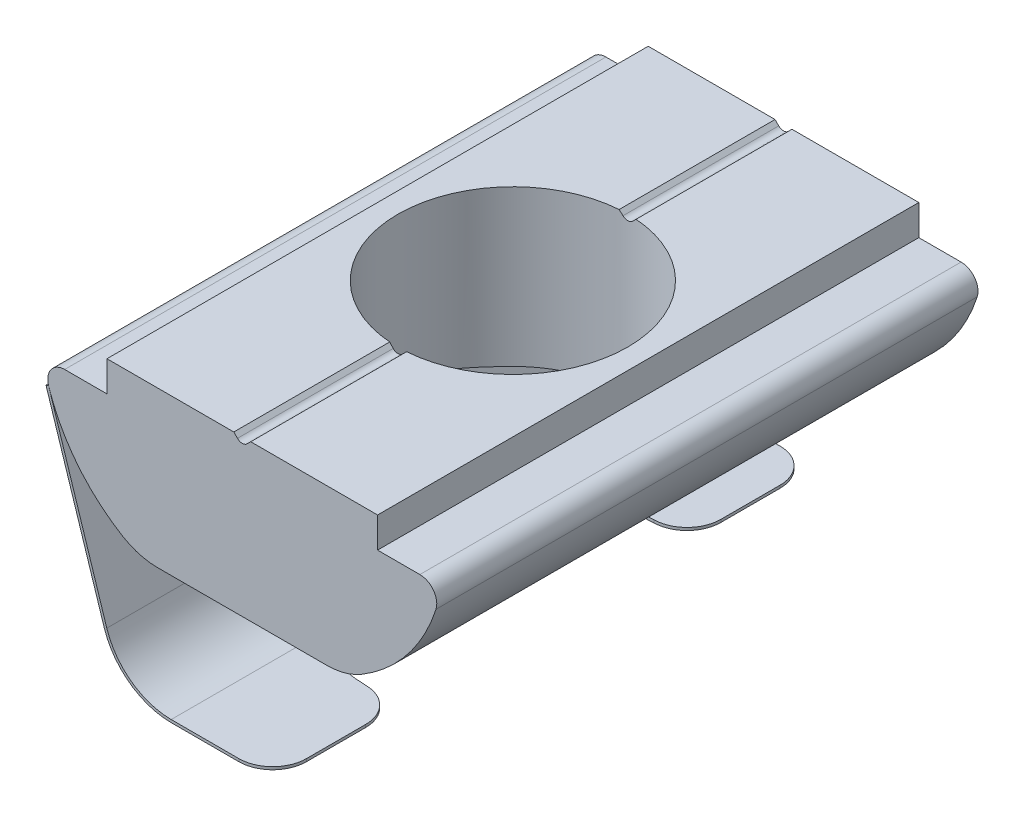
ISO-10303-21;
HEADER;
FILE_DESCRIPTION(('STEP AP214'),'2;1');
FILE_NAME('part.step','',(''),(''),'','','');
FILE_SCHEMA(('AUTOMOTIVE_DESIGN { 1 0 10303 214 1 1 1 1 }'));
ENDSEC;
DATA;
#1=APPLICATION_CONTEXT('core data for automotive mechanical design processes');
#2=APPLICATION_PROTOCOL_DEFINITION('international standard','automotive_design',2000,#1);
#3=PRODUCT_CONTEXT('',#1,'mechanical');
#4=PRODUCT('Part','Part','',(#3));
#5=PRODUCT_RELATED_PRODUCT_CATEGORY('part','',(#4));
#6=PRODUCT_DEFINITION_FORMATION('','',#4);
#7=PRODUCT_DEFINITION_CONTEXT('part definition',#1,'design');
#8=PRODUCT_DEFINITION('design','',#6,#7);
#9=PRODUCT_DEFINITION_SHAPE('','',#8);
#10=(LENGTH_UNIT() NAMED_UNIT(*) SI_UNIT(.MILLI.,.METRE.));
#11=(NAMED_UNIT(*) PLANE_ANGLE_UNIT() SI_UNIT($,.RADIAN.));
#12=(NAMED_UNIT(*) SI_UNIT($,.STERADIAN.) SOLID_ANGLE_UNIT());
#13=UNCERTAINTY_MEASURE_WITH_UNIT(LENGTH_MEASURE(1.E-05),#10,'distance_accuracy_value','');
#14=(GEOMETRIC_REPRESENTATION_CONTEXT(3) GLOBAL_UNCERTAINTY_ASSIGNED_CONTEXT((#13)) GLOBAL_UNIT_ASSIGNED_CONTEXT((#10,
#11,#12)) REPRESENTATION_CONTEXT('',''));
#15=CARTESIAN_POINT('',(0.,0.,0.));
#16=DIRECTION('',(0.,0.,1.));
#17=DIRECTION('',(1.,0.,0.));
#18=AXIS2_PLACEMENT_3D('',#15,#16,#17);
#19=CARTESIAN_POINT('',(2.5,-4.6,0.));
#20=DIRECTION('',(0.,-1.,0.));
#21=DIRECTION('',(0.,0.,-1.));
#22=AXIS2_PLACEMENT_3D('',#19,#20,#21);
#23=PLANE('',#22);
#24=CARTESIAN_POINT('',(0.,-4.6,0.));
#25=DIRECTION('',(0.,-1.,0.));
#26=DIRECTION('',(0.,0.,-1.));
#27=AXIS2_PLACEMENT_3D('',#24,#25,#26);
#28=CIRCLE('',#27,3.4);
#29=CARTESIAN_POINT('',(2.5,-4.6,2.30434372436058));
#30=VERTEX_POINT('',#29);
#31=CARTESIAN_POINT('',(-2.5,-4.6,2.30434372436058));
#32=VERTEX_POINT('',#31);
#33=EDGE_CURVE('P0_E11',#30,#32,#28,.T.);
#34=ORIENTED_EDGE('',*,*,#33,.F.);
#35=DIRECTION('',(0.,0.,-1.));
#36=VECTOR('',#35,1.);
#37=CARTESIAN_POINT('',(2.5,-4.6,0.));
#38=LINE('',#37,#36);
#39=CARTESIAN_POINT('',(2.5,-4.6,8.));
#40=VERTEX_POINT('',#39);
#41=EDGE_CURVE('P0_E337',#30,#40,#38,.F.);
#42=ORIENTED_EDGE('',*,*,#41,.T.);
#43=DIRECTION('',(1.,0.,0.));
#44=VECTOR('',#43,1.);
#45=CARTESIAN_POINT('',(2.5,-4.6,8.));
#46=LINE('',#45,#44);
#47=CARTESIAN_POINT('',(-2.5,-4.6,8.));
#48=VERTEX_POINT('',#47);
#49=EDGE_CURVE('P0_E348',#40,#48,#46,.F.);
#50=ORIENTED_EDGE('',*,*,#49,.T.);
#51=DIRECTION('',(0.,0.,-1.));
#52=VECTOR('',#51,1.);
#53=CARTESIAN_POINT('',(-2.5,-4.6,0.));
#54=LINE('',#53,#52);
#55=EDGE_CURVE('P0_E338',#48,#32,#54,.T.);
#56=ORIENTED_EDGE('',*,*,#55,.T.);
#57=EDGE_LOOP('',(#34,#42,#50,#56));
#58=FACE_BOUND('',#57,.T.);
#59=ADVANCED_FACE('P0_F32',(#58),#23,.T.);
#60=CARTESIAN_POINT('',(-5.25,-1.4,0.));
#61=DIRECTION('',(0.,0.,1.));
#62=DIRECTION('',(1.,0.,0.));
#63=AXIS2_PLACEMENT_3D('',#60,#61,#62);
#64=CYLINDRICAL_SURFACE('',#63,0.5);
#65=CARTESIAN_POINT('',(-5.25,-1.4,-8.));
#66=DIRECTION('',(0.,0.,1.));
#67=DIRECTION('',(1.,0.,0.));
#68=AXIS2_PLACEMENT_3D('',#65,#66,#67);
#69=CIRCLE('',#68,0.5);
#70=CARTESIAN_POINT('',(-5.25,-0.9,-8.));
#71=VERTEX_POINT('',#70);
#72=CARTESIAN_POINT('',(-5.72596878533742,-1.55314605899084,-8.));
#73=VERTEX_POINT('',#72);
#74=EDGE_CURVE('P0_E283',#71,#73,#69,.T.);
#75=ORIENTED_EDGE('',*,*,#74,.T.);
#76=DIRECTION('',(0.,0.,1.));
#77=VECTOR('',#76,1.);
#78=CARTESIAN_POINT('',(-5.72596878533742,-1.55314605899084,0.));
#79=LINE('',#78,#77);
#80=CARTESIAN_POINT('',(-5.72596878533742,-1.55314605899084,8.));
#81=VERTEX_POINT('',#80);
#82=EDGE_CURVE('P0_E211',#81,#73,#79,.F.);
#83=ORIENTED_EDGE('',*,*,#82,.F.);
#84=CARTESIAN_POINT('',(-5.25,-1.4,8.));
#85=DIRECTION('',(0.,0.,1.));
#86=DIRECTION('',(1.,0.,0.));
#87=AXIS2_PLACEMENT_3D('',#84,#85,#86);
#88=CIRCLE('',#87,0.5);
#89=CARTESIAN_POINT('',(-5.25,-0.9,8.));
#90=VERTEX_POINT('',#89);
#91=EDGE_CURVE('P0_E317',#81,#90,#88,.F.);
#92=ORIENTED_EDGE('',*,*,#91,.T.);
#93=DIRECTION('',(0.,0.,1.));
#94=VECTOR('',#93,1.);
#95=CARTESIAN_POINT('',(-5.25,-0.9,0.));
#96=LINE('',#95,#94);
#97=EDGE_CURVE('P0_E279',#71,#90,#96,.T.);
#98=ORIENTED_EDGE('',*,*,#97,.F.);
#99=EDGE_LOOP('',(#75,#83,#92,#98));
#100=FACE_BOUND('',#99,.T.);
#101=ADVANCED_FACE('P0_F34',(#100),#64,.T.);
#102=CARTESIAN_POINT('',(-5.25,-0.9,0.));
#103=DIRECTION('',(0.,1.,0.));
#104=DIRECTION('',(0.,0.,1.));
#105=AXIS2_PLACEMENT_3D('',#102,#103,#104);
#106=PLANE('',#105);
#107=DIRECTION('',(1.,0.,0.));
#108=VECTOR('',#107,1.);
#109=CARTESIAN_POINT('',(-5.25,-0.9,-8.));
#110=LINE('',#109,#108);
#111=CARTESIAN_POINT('',(-4.,-0.9,-8.));
#112=VERTEX_POINT('',#111);
#113=EDGE_CURVE('P0_E276',#112,#71,#110,.F.);
#114=ORIENTED_EDGE('',*,*,#113,.T.);
#115=ORIENTED_EDGE('',*,*,#97,.T.);
#116=DIRECTION('',(1.,0.,0.));
#117=VECTOR('',#116,1.);
#118=CARTESIAN_POINT('',(-5.25,-0.9,8.));
#119=LINE('',#118,#117);
#120=CARTESIAN_POINT('',(-4.,-0.9,8.));
#121=VERTEX_POINT('',#120);
#122=EDGE_CURVE('P0_E280',#90,#121,#119,.T.);
#123=ORIENTED_EDGE('',*,*,#122,.T.);
#124=DIRECTION('',(0.,0.,1.));
#125=VECTOR('',#124,1.);
#126=CARTESIAN_POINT('',(-4.,-0.9,0.));
#127=LINE('',#126,#125);
#128=EDGE_CURVE('P0_E254',#112,#121,#127,.T.);
#129=ORIENTED_EDGE('',*,*,#128,.F.);
#130=EDGE_LOOP('',(#114,#115,#123,#129));
#131=FACE_BOUND('',#130,.T.);
#132=ADVANCED_FACE('P0_F372',(#131),#106,.T.);
#133=CARTESIAN_POINT('',(0.,0.03284271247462,8.));
#134=DIRECTION('',(0.,0.,-1.));
#135=DIRECTION('',(-1.,0.,0.));
#136=AXIS2_PLACEMENT_3D('',#133,#134,#135);
#137=CYLINDRICAL_SURFACE('',#136,0.2);
#138=DIRECTION('',(0.,0.,1.));
#139=VECTOR('',#138,1.);
#140=CARTESIAN_POINT('',(0.14142135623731,-0.108578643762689,8.));
#141=LINE('',#140,#139);
#142=CARTESIAN_POINT('',(0.14142135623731,-0.108578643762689,8.));
#143=VERTEX_POINT('',#142);
#144=CARTESIAN_POINT('',(0.14142135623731,-0.108578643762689,3.39705755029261));
#145=VERTEX_POINT('',#144);
#146=EDGE_CURVE('P0_E243',#143,#145,#141,.F.);
#147=ORIENTED_EDGE('',*,*,#146,.T.);
#148=CARTESIAN_POINT('',(0.141421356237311,-0.108578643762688,3.39705755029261));
#149=CARTESIAN_POINT('',(0.133474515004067,-0.116538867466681,3.39738934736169));
#150=CARTESIAN_POINT('',(0.124845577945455,-0.123813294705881,3.39771978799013));
#151=CARTESIAN_POINT('',(0.106498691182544,-0.13681375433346,3.39834376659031));
#152=CARTESIAN_POINT('',(0.0967815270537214,-0.142540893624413,3.39863733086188));
#153=CARTESIAN_POINT('',(0.0765159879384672,-0.152284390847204,3.39915407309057));
#154=CARTESIAN_POINT('',(0.0659671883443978,-0.156299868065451,3.39937721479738));
#155=CARTESIAN_POINT('',(0.044346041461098,-0.162502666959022,3.39972794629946));
#156=CARTESIAN_POINT('',(0.0332738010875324,-0.164690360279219,3.39985555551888));
#157=CARTESIAN_POINT('',(0.0109309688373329,-0.167174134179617,3.40000076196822));
#158=CARTESIAN_POINT('',(-0.000339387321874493,-0.16747232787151,3.40001848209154));
#159=CARTESIAN_POINT('',(-0.0227724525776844,-0.166173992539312,3.39994224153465));
#160=CARTESIAN_POINT('',(-0.0339351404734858,-0.164577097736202,3.39984825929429));
#161=CARTESIAN_POINT('',(-0.05582649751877,-0.159535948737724,3.39955927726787));
#162=CARTESIAN_POINT('',(-0.0665553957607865,-0.15609268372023,3.39936433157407));
#163=CARTESIAN_POINT('',(-0.0872798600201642,-0.147457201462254,3.39889535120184));
#164=CARTESIAN_POINT('',(-0.0972758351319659,-0.14226596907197,3.39862136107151));
#165=CARTESIAN_POINT('',(-0.113033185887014,-0.132319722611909,3.398126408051));
#166=CARTESIAN_POINT('',(-0.119082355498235,-0.128012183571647,3.3979189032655));
#167=CARTESIAN_POINT('',(-0.130657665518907,-0.118760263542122,3.39749351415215));
#168=CARTESIAN_POINT('',(-0.136184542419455,-0.11381680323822,3.39727564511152));
#169=CARTESIAN_POINT('',(-0.141421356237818,-0.108578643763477,3.39705755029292));
#170=B_SPLINE_CURVE_WITH_KNOTS('',3,(#148,#149,#150,#151,#152,#153,#154,#155,#156,#157,#158,
#159,#160,#161,#162,#163,#164,#165,#166,#167,#168,#169),.UNSPECIFIED.,.F.,.F.,(4,2,2,2,2,2,2,2,
2,2,4),(0.,0.0337142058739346,0.0674042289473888,0.101111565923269,0.134812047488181,
0.168474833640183,0.202144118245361,0.235795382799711,0.269427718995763,0.291672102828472,
0.313884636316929),.UNSPECIFIED.);
#171=CARTESIAN_POINT('',(-0.141421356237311,-0.108578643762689,3.39705755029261));
#172=VERTEX_POINT('',#171);
#173=EDGE_CURVE('P0_E184',#145,#172,#170,.T.);
#174=ORIENTED_EDGE('',*,*,#173,.T.);
#175=DIRECTION('',(0.,0.,1.));
#176=VECTOR('',#175,1.);
#177=CARTESIAN_POINT('',(-0.14142135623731,-0.108578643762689,8.));
#178=LINE('',#177,#176);
#179=CARTESIAN_POINT('',(-0.14142135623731,-0.108578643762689,8.));
#180=VERTEX_POINT('',#179);
#181=EDGE_CURVE('P0_E251',#172,#180,#178,.T.);
#182=ORIENTED_EDGE('',*,*,#181,.T.);
#183=CARTESIAN_POINT('',(0.,0.03284271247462,8.));
#184=DIRECTION('',(0.,0.,-1.));
#185=DIRECTION('',(-1.,0.,0.));
#186=AXIS2_PLACEMENT_3D('',#183,#184,#185);
#187=CIRCLE('',#186,0.2);
#188=EDGE_CURVE('P0_E273',#143,#180,#187,.T.);
#189=ORIENTED_EDGE('',*,*,#188,.F.);
#190=EDGE_LOOP('',(#147,#174,#182,#189));
#191=FACE_BOUND('',#190,.T.);
#192=ADVANCED_FACE('P0_F519',(#191),#137,.F.);
#193=CARTESIAN_POINT('',(4.,-0.9,0.));
#194=DIRECTION('',(0.,1.,0.));
#195=DIRECTION('',(0.,0.,1.));
#196=AXIS2_PLACEMENT_3D('',#193,#194,#195);
#197=PLANE('',#196);
#198=DIRECTION('',(1.,0.,0.));
#199=VECTOR('',#198,1.);
#200=CARTESIAN_POINT('',(4.,-0.9,-8.));
#201=LINE('',#200,#199);
#202=CARTESIAN_POINT('',(5.25,-0.9,-8.));
#203=VERTEX_POINT('',#202);
#204=CARTESIAN_POINT('',(4.,-0.9,-8.));
#205=VERTEX_POINT('',#204);
#206=EDGE_CURVE('P0_E265',#203,#205,#201,.F.);
#207=ORIENTED_EDGE('',*,*,#206,.T.);
#208=DIRECTION('',(0.,0.,-1.));
#209=VECTOR('',#208,1.);
#210=CARTESIAN_POINT('',(4.,-0.9,0.));
#211=LINE('',#210,#209);
#212=CARTESIAN_POINT('',(4.,-0.9,8.));
#213=VERTEX_POINT('',#212);
#214=EDGE_CURVE('P0_E285',#213,#205,#211,.T.);
#215=ORIENTED_EDGE('',*,*,#214,.F.);
#216=DIRECTION('',(1.,0.,0.));
#217=VECTOR('',#216,1.);
#218=CARTESIAN_POINT('',(4.,-0.9,8.));
#219=LINE('',#218,#217);
#220=CARTESIAN_POINT('',(5.25,-0.9,8.));
#221=VERTEX_POINT('',#220);
#222=EDGE_CURVE('P0_E270',#213,#221,#219,.T.);
#223=ORIENTED_EDGE('',*,*,#222,.T.);
#224=DIRECTION('',(0.,0.,1.));
#225=VECTOR('',#224,1.);
#226=CARTESIAN_POINT('',(5.25,-0.9,0.));
#227=LINE('',#226,#225);
#228=EDGE_CURVE('P0_E247',#203,#221,#227,.T.);
#229=ORIENTED_EDGE('',*,*,#228,.F.);
#230=EDGE_LOOP('',(#207,#215,#223,#229));
#231=FACE_BOUND('',#230,.T.);
#232=ADVANCED_FACE('P0_F400',(#231),#197,.T.);
#233=CARTESIAN_POINT('',(-4.,-0.9,0.));
#234=DIRECTION('',(-1.,0.,0.));
#235=DIRECTION('',(0.,0.,1.));
#236=AXIS2_PLACEMENT_3D('',#233,#234,#235);
#237=PLANE('',#236);
#238=DIRECTION('',(0.,1.,0.));
#239=VECTOR('',#238,1.);
#240=CARTESIAN_POINT('',(-4.,-0.9,-8.));
#241=LINE('',#240,#239);
#242=CARTESIAN_POINT('',(-4.,0.,-8.));
#243=VERTEX_POINT('',#242);
#244=EDGE_CURVE('P0_E260',#243,#112,#241,.F.);
#245=ORIENTED_EDGE('',*,*,#244,.T.);
#246=ORIENTED_EDGE('',*,*,#128,.T.);
#247=DIRECTION('',(0.,1.,0.));
#248=VECTOR('',#247,1.);
#249=CARTESIAN_POINT('',(-4.,-0.9,8.));
#250=LINE('',#249,#248);
#251=CARTESIAN_POINT('',(-4.,0.,8.));
#252=VERTEX_POINT('',#251);
#253=EDGE_CURVE('P0_E263',#121,#252,#250,.T.);
#254=ORIENTED_EDGE('',*,*,#253,.T.);
#255=DIRECTION('',(0.,0.,1.));
#256=VECTOR('',#255,1.);
#257=CARTESIAN_POINT('',(-4.,0.,0.));
#258=LINE('',#257,#256);
#259=EDGE_CURVE('P0_E229',#243,#252,#258,.T.);
#260=ORIENTED_EDGE('',*,*,#259,.F.);
#261=EDGE_LOOP('',(#245,#246,#254,#260));
#262=FACE_BOUND('',#261,.T.);
#263=ADVANCED_FACE('P0_F368',(#262),#237,.T.);
#264=CARTESIAN_POINT('',(-0.25,0.,8.));
#265=DIRECTION('',(-0.707106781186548,-0.707106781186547,0.));
#266=DIRECTION('',(0.707106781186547,-0.707106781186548,0.));
#267=AXIS2_PLACEMENT_3D('',#264,#265,#266);
#268=PLANE('',#267);
#269=ORIENTED_EDGE('',*,*,#181,.F.);
#270=CARTESIAN_POINT('',(0.,-0.25,0.));
#271=DIRECTION('',(-0.707106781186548,-0.707106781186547,0.));
#272=DIRECTION('',(-0.707106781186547,0.707106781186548,0.));
#273=AXIS2_PLACEMENT_3D('',#270,#271,#272);
#274=ELLIPSE('',#273,4.80832611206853,3.4);
#275=CARTESIAN_POINT('',(-0.25,0.,3.39079636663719));
#276=VERTEX_POINT('',#275);
#277=EDGE_CURVE('P0_E319',#172,#276,#274,.T.);
#278=ORIENTED_EDGE('',*,*,#277,.T.);
#279=DIRECTION('',(0.,0.,1.));
#280=VECTOR('',#279,1.);
#281=CARTESIAN_POINT('',(-0.25,0.,0.));
#282=LINE('',#281,#280);
#283=CARTESIAN_POINT('',(-0.25,0.,8.));
#284=VERTEX_POINT('',#283);
#285=EDGE_CURVE('P0_E226',#284,#276,#282,.F.);
#286=ORIENTED_EDGE('',*,*,#285,.F.);
#287=DIRECTION('',(0.707106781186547,-0.707106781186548,0.));
#288=VECTOR('',#287,1.);
#289=CARTESIAN_POINT('',(-0.25,0.,8.));
#290=LINE('',#289,#288);
#291=EDGE_CURVE('P0_E253',#180,#284,#290,.F.);
#292=ORIENTED_EDGE('',*,*,#291,.F.);
#293=EDGE_LOOP('',(#269,#278,#286,#292));
#294=FACE_BOUND('',#293,.T.);
#295=ADVANCED_FACE('P0_F580',(#294),#268,.F.);
#296=CARTESIAN_POINT('',(5.25,-1.4,0.));
#297=DIRECTION('',(0.,0.,1.));
#298=DIRECTION('',(1.,0.,0.));
#299=AXIS2_PLACEMENT_3D('',#296,#297,#298);
#300=CYLINDRICAL_SURFACE('',#299,0.5);
#301=CARTESIAN_POINT('',(5.25,-1.4,-8.));
#302=DIRECTION('',(0.,0.,1.));
#303=DIRECTION('',(1.,0.,0.));
#304=AXIS2_PLACEMENT_3D('',#301,#302,#303);
#305=CIRCLE('',#304,0.5);
#306=CARTESIAN_POINT('',(5.72596878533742,-1.55314605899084,-8.));
#307=VERTEX_POINT('',#306);
#308=EDGE_CURVE('P0_E268',#307,#203,#305,.T.);
#309=ORIENTED_EDGE('',*,*,#308,.T.);
#310=ORIENTED_EDGE('',*,*,#228,.T.);
#311=CARTESIAN_POINT('',(5.25,-1.4,8.));
#312=DIRECTION('',(0.,0.,1.));
#313=DIRECTION('',(1.,0.,0.));
#314=AXIS2_PLACEMENT_3D('',#311,#312,#313);
#315=CIRCLE('',#314,0.5);
#316=CARTESIAN_POINT('',(5.72596878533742,-1.55314605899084,8.));
#317=VERTEX_POINT('',#316);
#318=EDGE_CURVE('P0_E256',#221,#317,#315,.F.);
#319=ORIENTED_EDGE('',*,*,#318,.T.);
#320=DIRECTION('',(0.,0.,1.));
#321=VECTOR('',#320,1.);
#322=CARTESIAN_POINT('',(5.72596878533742,-1.55314605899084,0.));
#323=LINE('',#322,#321);
#324=EDGE_CURVE('P0_E206',#307,#317,#323,.T.);
#325=ORIENTED_EDGE('',*,*,#324,.F.);
#326=EDGE_LOOP('',(#309,#310,#319,#325));
#327=FACE_BOUND('',#326,.T.);
#328=ADVANCED_FACE('P0_F397',(#327),#300,.T.);
#329=CARTESIAN_POINT('',(0.,-0.249999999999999,8.));
#330=DIRECTION('',(0.707106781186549,-0.707106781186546,0.));
#331=DIRECTION('',(0.707106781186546,0.707106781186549,0.));
#332=AXIS2_PLACEMENT_3D('',#329,#330,#331);
#333=PLANE('',#332);
#334=DIRECTION('',(0.,0.,1.));
#335=VECTOR('',#334,1.);
#336=CARTESIAN_POINT('',(0.249999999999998,0.,0.));
#337=LINE('',#336,#335);
#338=CARTESIAN_POINT('',(0.249999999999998,0.,3.39079636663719));
#339=VERTEX_POINT('',#338);
#340=CARTESIAN_POINT('',(0.249999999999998,0.,8.));
#341=VERTEX_POINT('',#340);
#342=EDGE_CURVE('P0_E195',#339,#341,#337,.T.);
#343=ORIENTED_EDGE('',*,*,#342,.F.);
#344=CARTESIAN_POINT('',(0.,-0.249999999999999,0.));
#345=DIRECTION('',(0.707106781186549,-0.707106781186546,0.));
#346=DIRECTION('',(0.707106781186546,0.707106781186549,0.));
#347=AXIS2_PLACEMENT_3D('',#344,#345,#346);
#348=ELLIPSE('',#347,4.80832611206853,3.4);
#349=EDGE_CURVE('P0_E178',#339,#145,#348,.T.);
#350=ORIENTED_EDGE('',*,*,#349,.T.);
#351=ORIENTED_EDGE('',*,*,#146,.F.);
#352=DIRECTION('',(0.707106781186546,0.707106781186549,0.));
#353=VECTOR('',#352,1.);
#354=CARTESIAN_POINT('',(0.,-0.249999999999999,8.));
#355=LINE('',#354,#353);
#356=EDGE_CURVE('P0_E203',#341,#143,#355,.F.);
#357=ORIENTED_EDGE('',*,*,#356,.F.);
#358=EDGE_LOOP('',(#343,#350,#351,#357));
#359=FACE_BOUND('',#358,.T.);
#360=ADVANCED_FACE('P0_F202',(#359),#333,.F.);
#361=CARTESIAN_POINT('',(4.,0.,0.));
#362=DIRECTION('',(1.,0.,0.));
#363=DIRECTION('',(0.,0.,-1.));
#364=AXIS2_PLACEMENT_3D('',#361,#362,#363);
#365=PLANE('',#364);
#366=DIRECTION('',(0.,1.,0.));
#367=VECTOR('',#366,1.);
#368=CARTESIAN_POINT('',(4.,0.,-8.));
#369=LINE('',#368,#367);
#370=CARTESIAN_POINT('',(4.,0.,-8.));
#371=VERTEX_POINT('',#370);
#372=EDGE_CURVE('P0_E238',#205,#371,#369,.T.);
#373=ORIENTED_EDGE('',*,*,#372,.T.);
#374=DIRECTION('',(0.,0.,1.));
#375=VECTOR('',#374,1.);
#376=CARTESIAN_POINT('',(4.,0.,0.));
#377=LINE('',#376,#375);
#378=CARTESIAN_POINT('',(4.,0.,8.));
#379=VERTEX_POINT('',#378);
#380=EDGE_CURVE('P0_E205',#379,#371,#377,.F.);
#381=ORIENTED_EDGE('',*,*,#380,.F.);
#382=DIRECTION('',(0.,1.,0.));
#383=VECTOR('',#382,1.);
#384=CARTESIAN_POINT('',(4.,0.,8.));
#385=LINE('',#384,#383);
#386=EDGE_CURVE('P0_E245',#379,#213,#385,.F.);
#387=ORIENTED_EDGE('',*,*,#386,.T.);
#388=ORIENTED_EDGE('',*,*,#214,.T.);
#389=EDGE_LOOP('',(#373,#381,#387,#388));
#390=FACE_BOUND('',#389,.T.);
#391=ADVANCED_FACE('P0_F405',(#390),#365,.T.);
#392=CARTESIAN_POINT('',(0.,-0.249999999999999,8.));
#393=DIRECTION('',(0.707106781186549,-0.707106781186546,0.));
#394=DIRECTION('',(0.707106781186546,0.707106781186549,0.));
#395=AXIS2_PLACEMENT_3D('',#392,#393,#394);
#396=PLANE('',#395);
#397=DIRECTION('',(0.,0.,-1.));
#398=VECTOR('',#397,1.);
#399=CARTESIAN_POINT('',(0.14142135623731,-0.108578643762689,8.));
#400=LINE('',#399,#398);
#401=CARTESIAN_POINT('',(0.14142135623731,-0.108578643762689,-8.));
#402=VERTEX_POINT('',#401);
#403=CARTESIAN_POINT('',(0.141421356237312,-0.108578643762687,-3.39705755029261));
#404=VERTEX_POINT('',#403);
#405=EDGE_CURVE('P0_E232',#402,#404,#400,.F.);
#406=ORIENTED_EDGE('',*,*,#405,.T.);
#407=CARTESIAN_POINT('',(0.,-0.249999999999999,0.));
#408=DIRECTION('',(0.707106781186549,-0.707106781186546,0.));
#409=DIRECTION('',(0.707106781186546,0.707106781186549,0.));
#410=AXIS2_PLACEMENT_3D('',#407,#408,#409);
#411=ELLIPSE('',#410,4.80832611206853,3.4);
#412=CARTESIAN_POINT('',(0.249999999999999,0.,-3.39079636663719));
#413=VERTEX_POINT('',#412);
#414=EDGE_CURVE('P0_E189',#404,#413,#411,.T.);
#415=ORIENTED_EDGE('',*,*,#414,.T.);
#416=DIRECTION('',(0.,0.,1.));
#417=VECTOR('',#416,1.);
#418=CARTESIAN_POINT('',(0.249999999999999,0.,0.));
#419=LINE('',#418,#417);
#420=CARTESIAN_POINT('',(0.249999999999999,0.,-8.));
#421=VERTEX_POINT('',#420);
#422=EDGE_CURVE('P0_E199',#421,#413,#419,.T.);
#423=ORIENTED_EDGE('',*,*,#422,.F.);
#424=DIRECTION('',(0.707106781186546,0.707106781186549,0.));
#425=VECTOR('',#424,1.);
#426=CARTESIAN_POINT('',(0.,-0.249999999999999,-8.));
#427=LINE('',#426,#425);
#428=EDGE_CURVE('P0_E236',#402,#421,#427,.T.);
#429=ORIENTED_EDGE('',*,*,#428,.F.);
#430=EDGE_LOOP('',(#406,#415,#423,#429));
#431=FACE_BOUND('',#430,.T.);
#432=ADVANCED_FACE('P0_F410',(#431),#396,.F.);
#433=CARTESIAN_POINT('',(0.,0.03284271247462,8.));
#434=DIRECTION('',(0.,0.,-1.));
#435=DIRECTION('',(-1.,0.,0.));
#436=AXIS2_PLACEMENT_3D('',#433,#434,#435);
#437=CYLINDRICAL_SURFACE('',#436,0.2);
#438=DIRECTION('',(0.,0.,1.));
#439=VECTOR('',#438,1.);
#440=CARTESIAN_POINT('',(-0.14142135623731,-0.108578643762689,8.));
#441=LINE('',#440,#439);
#442=CARTESIAN_POINT('',(-0.14142135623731,-0.108578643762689,-8.));
#443=VERTEX_POINT('',#442);
#444=CARTESIAN_POINT('',(-0.14142135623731,-0.108578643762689,-3.39705755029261));
#445=VERTEX_POINT('',#444);
#446=EDGE_CURVE('P0_E218',#443,#445,#441,.T.);
#447=ORIENTED_EDGE('',*,*,#446,.T.);
#448=CARTESIAN_POINT('',(-0.14142135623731,-0.108578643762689,-3.39705755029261));
#449=CARTESIAN_POINT('',(-0.133474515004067,-0.116538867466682,-3.39738934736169));
#450=CARTESIAN_POINT('',(-0.124845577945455,-0.123813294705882,-3.39771978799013));
#451=CARTESIAN_POINT('',(-0.106498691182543,-0.13681375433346,-3.39834376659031));
#452=CARTESIAN_POINT('',(-0.0967815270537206,-0.142540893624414,-3.39863733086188));
#453=CARTESIAN_POINT('',(-0.0765159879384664,-0.152284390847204,-3.39915407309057));
#454=CARTESIAN_POINT('',(-0.0659671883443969,-0.156299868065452,-3.39937721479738));
#455=CARTESIAN_POINT('',(-0.0443460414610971,-0.162502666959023,-3.39972794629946));
#456=CARTESIAN_POINT('',(-0.0332738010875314,-0.164690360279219,-3.39985555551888));
#457=CARTESIAN_POINT('',(-0.010930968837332,-0.167174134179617,-3.40000076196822));
#458=CARTESIAN_POINT('',(0.000339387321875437,-0.16747232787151,-3.40001848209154));
#459=CARTESIAN_POINT('',(0.0227724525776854,-0.166173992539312,-3.39994224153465));
#460=CARTESIAN_POINT('',(0.0339351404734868,-0.164577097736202,-3.39984825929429));
#461=CARTESIAN_POINT('',(0.0558264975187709,-0.159535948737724,-3.39955927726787));
#462=CARTESIAN_POINT('',(0.0665553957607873,-0.156092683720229,-3.39936433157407));
#463=CARTESIAN_POINT('',(0.087279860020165,-0.147457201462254,-3.39889535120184));
#464=CARTESIAN_POINT('',(0.0972758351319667,-0.142265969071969,-3.39862136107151));
#465=CARTESIAN_POINT('',(0.113033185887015,-0.132319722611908,-3.398126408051));
#466=CARTESIAN_POINT('',(0.119082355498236,-0.128012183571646,-3.3979189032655));
#467=CARTESIAN_POINT('',(0.130657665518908,-0.118760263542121,-3.39749351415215));
#468=CARTESIAN_POINT('',(0.136184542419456,-0.113816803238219,-3.39727564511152));
#469=CARTESIAN_POINT('',(0.141421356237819,-0.108578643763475,-3.39705755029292));
#470=B_SPLINE_CURVE_WITH_KNOTS('',3,(#448,#449,#450,#451,#452,#453,#454,#455,#456,#457,#458,
#459,#460,#461,#462,#463,#464,#465,#466,#467,#468,#469),.UNSPECIFIED.,.F.,.F.,(4,2,2,2,2,2,2,2,
2,2,4),(0.,0.0337142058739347,0.0674042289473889,0.101111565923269,0.134812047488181,
0.168474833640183,0.202144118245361,0.235795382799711,0.269427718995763,0.291672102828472,
0.31388463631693),.UNSPECIFIED.);
#471=EDGE_CURVE('P0_E47',#445,#404,#470,.T.);
#472=ORIENTED_EDGE('',*,*,#471,.T.);
#473=ORIENTED_EDGE('',*,*,#405,.F.);
#474=CARTESIAN_POINT('',(0.,0.03284271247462,-8.));
#475=DIRECTION('',(0.,0.,-1.));
#476=DIRECTION('',(-1.,0.,0.));
#477=AXIS2_PLACEMENT_3D('',#474,#475,#476);
#478=CIRCLE('',#477,0.2);
#479=EDGE_CURVE('P0_E235',#443,#402,#478,.F.);
#480=ORIENTED_EDGE('',*,*,#479,.F.);
#481=EDGE_LOOP('',(#447,#472,#473,#480));
#482=FACE_BOUND('',#481,.T.);
#483=ADVANCED_FACE('P0_F420',(#482),#437,.F.);
#484=CARTESIAN_POINT('',(-4.,0.,0.));
#485=DIRECTION('',(0.,1.,0.));
#486=DIRECTION('',(0.,0.,1.));
#487=AXIS2_PLACEMENT_3D('',#484,#485,#486);
#488=PLANE('',#487);
#489=CARTESIAN_POINT('',(0.,0.,0.));
#490=DIRECTION('',(0.,1.,0.));
#491=DIRECTION('',(0.,0.,1.));
#492=AXIS2_PLACEMENT_3D('',#489,#490,#491);
#493=CIRCLE('',#492,3.4);
#494=CARTESIAN_POINT('',(-0.249999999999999,0.,-3.39079636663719));
#495=VERTEX_POINT('',#494);
#496=EDGE_CURVE('P0_E200',#495,#276,#493,.T.);
#497=ORIENTED_EDGE('',*,*,#496,.F.);
#498=DIRECTION('',(0.,0.,1.));
#499=VECTOR('',#498,1.);
#500=CARTESIAN_POINT('',(-0.249999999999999,0.,8.));
#501=LINE('',#500,#499);
#502=CARTESIAN_POINT('',(-0.25,0.,-8.));
#503=VERTEX_POINT('',#502);
#504=EDGE_CURVE('P0_E353',#495,#503,#501,.F.);
#505=ORIENTED_EDGE('',*,*,#504,.T.);
#506=DIRECTION('',(1.,0.,0.));
#507=VECTOR('',#506,1.);
#508=CARTESIAN_POINT('',(0.,0.,-8.));
#509=LINE('',#508,#507);
#510=EDGE_CURVE('P0_E222',#503,#243,#509,.F.);
#511=ORIENTED_EDGE('',*,*,#510,.T.);
#512=ORIENTED_EDGE('',*,*,#259,.T.);
#513=DIRECTION('',(1.,0.,0.));
#514=VECTOR('',#513,1.);
#515=CARTESIAN_POINT('',(0.,0.,8.));
#516=LINE('',#515,#514);
#517=EDGE_CURVE('P0_E217',#284,#252,#516,.F.);
#518=ORIENTED_EDGE('',*,*,#517,.F.);
#519=ORIENTED_EDGE('',*,*,#285,.T.);
#520=EDGE_LOOP('',(#497,#505,#511,#512,#518,#519));
#521=FACE_BOUND('',#520,.T.);
#522=ADVANCED_FACE('P0_F359',(#521),#488,.T.);
#523=CARTESIAN_POINT('',(-0.966280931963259,-0.021685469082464,0.));
#524=DIRECTION('',(0.,0.,1.));
#525=DIRECTION('',(1.,0.,0.));
#526=AXIS2_PLACEMENT_3D('',#523,#524,#525);
#527=CYLINDRICAL_SURFACE('',#526,5.);
#528=CARTESIAN_POINT('',(-0.966280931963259,-0.021685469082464,-8.));
#529=DIRECTION('',(0.,0.,1.));
#530=DIRECTION('',(1.,0.,0.));
#531=AXIS2_PLACEMENT_3D('',#528,#529,#530);
#532=CIRCLE('',#531,5.);
#533=CARTESIAN_POINT('',(-3.52247937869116,-4.31887635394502,-8.));
#534=VERTEX_POINT('',#533);
#535=EDGE_CURVE('P0_E300',#73,#534,#532,.T.);
#536=ORIENTED_EDGE('',*,*,#535,.T.);
#537=DIRECTION('',(0.,0.,1.));
#538=VECTOR('',#537,1.);
#539=CARTESIAN_POINT('',(-3.52247937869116,-4.31887635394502,0.));
#540=LINE('',#539,#538);
#541=CARTESIAN_POINT('',(-3.52247937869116,-4.31887635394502,8.));
#542=VERTEX_POINT('',#541);
#543=EDGE_CURVE('P0_E219',#542,#534,#540,.F.);
#544=ORIENTED_EDGE('',*,*,#543,.F.);
#545=CARTESIAN_POINT('',(-0.966280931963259,-0.021685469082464,8.));
#546=DIRECTION('',(0.,0.,1.));
#547=DIRECTION('',(1.,0.,0.));
#548=AXIS2_PLACEMENT_3D('',#545,#546,#547);
#549=CIRCLE('',#548,5.);
#550=EDGE_CURVE('P0_E259',#81,#542,#549,.T.);
#551=ORIENTED_EDGE('',*,*,#550,.F.);
#552=ORIENTED_EDGE('',*,*,#82,.T.);
#553=EDGE_LOOP('',(#536,#544,#551,#552));
#554=FACE_BOUND('',#553,.T.);
#555=ADVANCED_FACE('P0_F378',(#554),#527,.T.);
#556=CARTESIAN_POINT('',(0.966280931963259,-0.021685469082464,0.));
#557=DIRECTION('',(0.,0.,1.));
#558=DIRECTION('',(1.,0.,0.));
#559=AXIS2_PLACEMENT_3D('',#556,#557,#558);
#560=CYLINDRICAL_SURFACE('',#559,5.);
#561=CARTESIAN_POINT('',(0.966280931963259,-0.021685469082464,-8.));
#562=DIRECTION('',(0.,0.,1.));
#563=DIRECTION('',(1.,0.,0.));
#564=AXIS2_PLACEMENT_3D('',#561,#562,#563);
#565=CIRCLE('',#564,5.);
#566=CARTESIAN_POINT('',(3.52247937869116,-4.31887635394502,-8.));
#567=VERTEX_POINT('',#566);
#568=EDGE_CURVE('P0_E242',#567,#307,#565,.T.);
#569=ORIENTED_EDGE('',*,*,#568,.T.);
#570=ORIENTED_EDGE('',*,*,#324,.T.);
#571=CARTESIAN_POINT('',(0.966280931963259,-0.021685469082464,8.));
#572=DIRECTION('',(0.,0.,1.));
#573=DIRECTION('',(1.,0.,0.));
#574=AXIS2_PLACEMENT_3D('',#571,#572,#573);
#575=CIRCLE('',#574,5.);
#576=CARTESIAN_POINT('',(3.52247937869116,-4.31887635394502,8.));
#577=VERTEX_POINT('',#576);
#578=EDGE_CURVE('P0_E250',#577,#317,#575,.T.);
#579=ORIENTED_EDGE('',*,*,#578,.F.);
#580=DIRECTION('',(0.,0.,1.));
#581=VECTOR('',#580,1.);
#582=CARTESIAN_POINT('',(3.52247937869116,-4.31887635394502,0.));
#583=LINE('',#582,#581);
#584=EDGE_CURVE('P0_E215',#567,#577,#583,.T.);
#585=ORIENTED_EDGE('',*,*,#584,.F.);
#586=EDGE_LOOP('',(#569,#570,#579,#585));
#587=FACE_BOUND('',#586,.T.);
#588=ADVANCED_FACE('P0_F393',(#587),#560,.T.);
#589=CARTESIAN_POINT('',(-4.,0.,0.));
#590=DIRECTION('',(0.,1.,0.));
#591=DIRECTION('',(0.,0.,1.));
#592=AXIS2_PLACEMENT_3D('',#589,#590,#591);
#593=PLANE('',#592);
#594=EDGE_CURVE('P0_E181',#339,#413,#493,.T.);
#595=ORIENTED_EDGE('',*,*,#594,.F.);
#596=ORIENTED_EDGE('',*,*,#342,.T.);
#597=DIRECTION('',(1.,0.,0.));
#598=VECTOR('',#597,1.);
#599=CARTESIAN_POINT('',(0.,0.,8.));
#600=LINE('',#599,#598);
#601=EDGE_CURVE('P0_E248',#379,#341,#600,.F.);
#602=ORIENTED_EDGE('',*,*,#601,.F.);
#603=ORIENTED_EDGE('',*,*,#380,.T.);
#604=DIRECTION('',(1.,0.,0.));
#605=VECTOR('',#604,1.);
#606=CARTESIAN_POINT('',(0.,0.,-8.));
#607=LINE('',#606,#605);
#608=EDGE_CURVE('P0_E239',#371,#421,#607,.F.);
#609=ORIENTED_EDGE('',*,*,#608,.T.);
#610=ORIENTED_EDGE('',*,*,#422,.T.);
#611=EDGE_LOOP('',(#595,#596,#602,#603,#609,#610));
#612=FACE_BOUND('',#611,.T.);
#613=ADVANCED_FACE('P0_F193',(#612),#593,.T.);
#614=CARTESIAN_POINT('',(-0.25,0.,8.));
#615=DIRECTION('',(-0.707106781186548,-0.707106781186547,0.));
#616=DIRECTION('',(0.707106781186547,-0.707106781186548,0.));
#617=AXIS2_PLACEMENT_3D('',#614,#615,#616);
#618=PLANE('',#617);
#619=ORIENTED_EDGE('',*,*,#504,.F.);
#620=CARTESIAN_POINT('',(0.,-0.25,0.));
#621=DIRECTION('',(-0.707106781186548,-0.707106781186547,0.));
#622=DIRECTION('',(-0.707106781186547,0.707106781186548,0.));
#623=AXIS2_PLACEMENT_3D('',#620,#621,#622);
#624=ELLIPSE('',#623,4.80832611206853,3.4);
#625=EDGE_CURVE('P0_E412',#495,#445,#624,.T.);
#626=ORIENTED_EDGE('',*,*,#625,.T.);
#627=ORIENTED_EDGE('',*,*,#446,.F.);
#628=DIRECTION('',(-0.707106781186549,0.707106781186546,0.));
#629=VECTOR('',#628,1.);
#630=CARTESIAN_POINT('',(-0.14142135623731,-0.108578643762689,-8.));
#631=LINE('',#630,#629);
#632=EDGE_CURVE('P0_E241',#443,#503,#631,.T.);
#633=ORIENTED_EDGE('',*,*,#632,.T.);
#634=EDGE_LOOP('',(#619,#626,#627,#633));
#635=FACE_BOUND('',#634,.T.);
#636=ADVANCED_FACE('P0_F446',(#635),#618,.F.);
#637=CARTESIAN_POINT('',(2.5,-2.6,0.));
#638=DIRECTION('',(0.,0.,1.));
#639=DIRECTION('',(1.,0.,0.));
#640=AXIS2_PLACEMENT_3D('',#637,#638,#639);
#641=CYLINDRICAL_SURFACE('',#640,2.);
#642=CARTESIAN_POINT('',(2.5,-4.6,-2.30434372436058));
#643=CARTESIAN_POINT('',(2.55764044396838,-4.59998944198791,-2.24182321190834));
#644=CARTESIAN_POINT('',(2.61287668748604,-4.59750961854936,-2.17717641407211));
#645=CARTESIAN_POINT('',(2.71818937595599,-4.58876624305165,-2.04416634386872));
#646=CARTESIAN_POINT('',(2.76827199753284,-4.5825072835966,-1.97580767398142));
#647=CARTESIAN_POINT('',(2.86305889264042,-4.56735617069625,-1.83576843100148));
#648=CARTESIAN_POINT('',(2.90776411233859,-4.55846448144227,-1.76408844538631));
#649=CARTESIAN_POINT('',(2.99164525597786,-4.53910691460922,-1.61777037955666));
#650=CARTESIAN_POINT('',(3.03081926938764,-4.52864049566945,-1.54313128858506));
#651=CARTESIAN_POINT('',(3.1422847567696,-4.49568819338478,-1.31007941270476));
#652=CARTESIAN_POINT('',(3.2053493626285,-4.47228609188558,-1.14720206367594));
#653=CARTESIAN_POINT('',(3.2807461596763,-4.44151013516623,-0.8968413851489));
#654=CARTESIAN_POINT('',(3.30268021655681,-4.4319715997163,-0.812367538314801));
#655=CARTESIAN_POINT('',(3.34001974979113,-4.41515560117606,-0.641777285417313));
#656=CARTESIAN_POINT('',(3.35542827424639,-4.40787708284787,-0.555661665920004));
#657=CARTESIAN_POINT('',(3.38056280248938,-4.39577891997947,-0.375185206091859));
#658=CARTESIAN_POINT('',(3.38971895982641,-4.39120996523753,-0.280727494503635));
#659=CARTESIAN_POINT('',(3.40009868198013,-4.38601700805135,-0.0912622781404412));
#660=CARTESIAN_POINT('',(3.40132204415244,-4.38539310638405,0.00374524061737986));
#661=CARTESIAN_POINT('',(3.39581599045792,-4.38816183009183,0.19352245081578));
#662=CARTESIAN_POINT('',(3.38908204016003,-4.39155674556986,0.288291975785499));
#663=CARTESIAN_POINT('',(3.3677472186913,-4.40198620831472,0.476729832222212));
#664=CARTESIAN_POINT('',(3.35314644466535,-4.4090207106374,0.570398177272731));
#665=CARTESIAN_POINT('',(3.31788287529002,-4.42521438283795,0.747720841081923));
#666=CARTESIAN_POINT('',(3.2978707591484,-4.43413048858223,0.831527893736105));
#667=CARTESIAN_POINT('',(3.25160837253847,-4.45356722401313,0.99722116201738));
#668=CARTESIAN_POINT('',(3.22535576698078,-4.46408845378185,1.07910664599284));
#669=CARTESIAN_POINT('',(3.13751526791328,-4.49670608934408,1.32114109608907));
#670=CARTESIAN_POINT('',(3.06678967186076,-4.51988681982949,1.47794257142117));
#671=CARTESIAN_POINT('',(2.91822526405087,-4.5569710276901,1.75017077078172));
#672=CARTESIAN_POINT('',(2.84445806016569,-4.57180208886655,1.86770593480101));
#673=CARTESIAN_POINT('',(2.72313488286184,-4.58793274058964,2.03699843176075));
#674=CARTESIAN_POINT('',(2.6808862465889,-4.59229108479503,2.09229227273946));
#675=CARTESIAN_POINT('',(2.59296479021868,-4.59832360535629,2.20031710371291));
#676=CARTESIAN_POINT('',(2.54728896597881,-4.59999539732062,2.25304577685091));
#677=CARTESIAN_POINT('',(2.5,-4.6,2.30434372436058));
#678=B_SPLINE_CURVE_WITH_KNOTS('',3,(#642,#643,#644,#645,#646,#647,#648,#649,#650,#651,#652,
#653,#654,#655,#656,#657,#658,#659,#660,#661,#662,#663,#664,#665,#666,#667,#668,#669,#670,#671,
#672,#673,#674,#675,#676,#677),.UNSPECIFIED.,.F.,.F.,(4,2,2,2,2,2,2,2,2,2,2,2,2,2,2,2,2,4),(0.,
0.25491860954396,0.50952805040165,0.764092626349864,1.01874491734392,1.54492957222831,
1.80809917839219,2.07114572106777,2.35577082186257,2.64040319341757,2.9251978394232,
3.20998896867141,3.46958157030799,3.72927146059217,4.24781496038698,4.66531438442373,
4.8743176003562,5.08350621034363),.UNSPECIFIED.);
#679=CARTESIAN_POINT('',(2.5,-4.6,-2.30434372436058));
#680=VERTEX_POINT('',#679);
#681=EDGE_CURVE('P0_E437',#680,#30,#678,.T.);
#682=ORIENTED_EDGE('',*,*,#681,.F.);
#683=CARTESIAN_POINT('',(2.5,-4.6,-8.));
#684=VERTEX_POINT('',#683);
#685=EDGE_CURVE('P0_E345',#684,#680,#38,.F.);
#686=ORIENTED_EDGE('',*,*,#685,.F.);
#687=CARTESIAN_POINT('',(2.5,-2.6,-8.));
#688=DIRECTION('',(0.,0.,1.));
#689=DIRECTION('',(1.,0.,0.));
#690=AXIS2_PLACEMENT_3D('',#687,#688,#689);
#691=CIRCLE('',#690,2.);
#692=EDGE_CURVE('P0_E294',#684,#567,#691,.T.);
#693=ORIENTED_EDGE('',*,*,#692,.T.);
#694=ORIENTED_EDGE('',*,*,#584,.T.);
#695=CARTESIAN_POINT('',(2.5,-2.6,8.));
#696=DIRECTION('',(0.,0.,1.));
#697=DIRECTION('',(1.,0.,0.));
#698=AXIS2_PLACEMENT_3D('',#695,#696,#697);
#699=CIRCLE('',#698,2.);
#700=EDGE_CURVE('P0_E306',#40,#577,#699,.T.);
#701=ORIENTED_EDGE('',*,*,#700,.F.);
#702=ORIENTED_EDGE('',*,*,#41,.F.);
#703=EDGE_LOOP('',(#682,#686,#693,#694,#701,#702));
#704=FACE_BOUND('',#703,.T.);
#705=ADVANCED_FACE('P0_F390',(#704),#641,.T.);
#706=CARTESIAN_POINT('',(0.,-2.10067675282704,8.));
#707=DIRECTION('',(0.,0.,1.));
#708=DIRECTION('',(1.,0.,0.));
#709=AXIS2_PLACEMENT_3D('',#706,#707,#708);
#710=PLANE('',#709);
#711=ORIENTED_EDGE('',*,*,#356,.T.);
#712=ORIENTED_EDGE('',*,*,#188,.T.);
#713=ORIENTED_EDGE('',*,*,#291,.T.);
#714=ORIENTED_EDGE('',*,*,#517,.T.);
#715=ORIENTED_EDGE('',*,*,#253,.F.);
#716=ORIENTED_EDGE('',*,*,#122,.F.);
#717=ORIENTED_EDGE('',*,*,#91,.F.);
#718=ORIENTED_EDGE('',*,*,#550,.T.);
#719=CARTESIAN_POINT('',(-2.5,-2.6,8.));
#720=DIRECTION('',(0.,0.,1.));
#721=DIRECTION('',(1.,0.,0.));
#722=AXIS2_PLACEMENT_3D('',#719,#720,#721);
#723=CIRCLE('',#722,2.);
#724=EDGE_CURVE('P0_E223',#48,#542,#723,.F.);
#725=ORIENTED_EDGE('',*,*,#724,.F.);
#726=ORIENTED_EDGE('',*,*,#49,.F.);
#727=ORIENTED_EDGE('',*,*,#700,.T.);
#728=ORIENTED_EDGE('',*,*,#578,.T.);
#729=ORIENTED_EDGE('',*,*,#318,.F.);
#730=ORIENTED_EDGE('',*,*,#222,.F.);
#731=ORIENTED_EDGE('',*,*,#386,.F.);
#732=ORIENTED_EDGE('',*,*,#601,.T.);
#733=EDGE_LOOP('',(#711,#712,#713,#714,#715,#716,#717,#718,#725,#726,#727,#728,#729,#730,#731,#732));
#734=FACE_BOUND('',#733,.T.);
#735=ADVANCED_FACE('P0_F370',(#734),#710,.T.);
#736=CARTESIAN_POINT('',(-2.5,-2.6,0.));
#737=DIRECTION('',(0.,0.,1.));
#738=DIRECTION('',(1.,0.,0.));
#739=AXIS2_PLACEMENT_3D('',#736,#737,#738);
#740=CYLINDRICAL_SURFACE('',#739,2.);
#741=CARTESIAN_POINT('',(-2.5,-4.6,2.30434372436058));
#742=CARTESIAN_POINT('',(-2.55764044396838,-4.59998944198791,2.24182321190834));
#743=CARTESIAN_POINT('',(-2.61287668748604,-4.59750961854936,2.17717641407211));
#744=CARTESIAN_POINT('',(-2.71818937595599,-4.58876624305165,2.04416634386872));
#745=CARTESIAN_POINT('',(-2.76827199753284,-4.5825072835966,1.97580767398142));
#746=CARTESIAN_POINT('',(-2.86305889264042,-4.56735617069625,1.83576843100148));
#747=CARTESIAN_POINT('',(-2.90776411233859,-4.55846448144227,1.76408844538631));
#748=CARTESIAN_POINT('',(-2.99164525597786,-4.53910691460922,1.61777037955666));
#749=CARTESIAN_POINT('',(-3.03081926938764,-4.52864049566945,1.54313128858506));
#750=CARTESIAN_POINT('',(-3.1422847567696,-4.49568819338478,1.31007941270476));
#751=CARTESIAN_POINT('',(-3.2053493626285,-4.47228609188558,1.14720206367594));
#752=CARTESIAN_POINT('',(-3.28074615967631,-4.44151013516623,0.896841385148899));
#753=CARTESIAN_POINT('',(-3.30268021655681,-4.4319715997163,0.8123675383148));
#754=CARTESIAN_POINT('',(-3.34001974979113,-4.41515560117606,0.641777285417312));
#755=CARTESIAN_POINT('',(-3.35542827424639,-4.40787708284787,0.555661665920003));
#756=CARTESIAN_POINT('',(-3.38056280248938,-4.39577891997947,0.375185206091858));
#757=CARTESIAN_POINT('',(-3.38971895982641,-4.39120996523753,0.280727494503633));
#758=CARTESIAN_POINT('',(-3.40009868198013,-4.38601700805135,0.0912622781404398));
#759=CARTESIAN_POINT('',(-3.40132204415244,-4.38539310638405,-0.00374524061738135));
#760=CARTESIAN_POINT('',(-3.39581599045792,-4.38816183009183,-0.193522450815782));
#761=CARTESIAN_POINT('',(-3.38908204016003,-4.39155674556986,-0.2882919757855));
#762=CARTESIAN_POINT('',(-3.3677472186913,-4.40198620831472,-0.476729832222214));
#763=CARTESIAN_POINT('',(-3.35314644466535,-4.4090207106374,-0.570398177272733));
#764=CARTESIAN_POINT('',(-3.31788287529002,-4.42521438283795,-0.747720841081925));
#765=CARTESIAN_POINT('',(-3.2978707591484,-4.43413048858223,-0.831527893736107));
#766=CARTESIAN_POINT('',(-3.25160837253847,-4.45356722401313,-0.997221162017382));
#767=CARTESIAN_POINT('',(-3.22535576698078,-4.46408845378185,-1.07910664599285));
#768=CARTESIAN_POINT('',(-3.13751526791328,-4.49670608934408,-1.32114109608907));
#769=CARTESIAN_POINT('',(-3.06678967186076,-4.51988681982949,-1.47794257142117));
#770=CARTESIAN_POINT('',(-2.91822526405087,-4.5569710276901,-1.75017077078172));
#771=CARTESIAN_POINT('',(-2.84445806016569,-4.57180208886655,-1.86770593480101));
#772=CARTESIAN_POINT('',(-2.72313488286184,-4.58793274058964,-2.03699843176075));
#773=CARTESIAN_POINT('',(-2.6808862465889,-4.59229108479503,-2.09229227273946));
#774=CARTESIAN_POINT('',(-2.59296479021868,-4.59832360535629,-2.20031710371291));
#775=CARTESIAN_POINT('',(-2.54728896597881,-4.59999539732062,-2.25304577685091));
#776=CARTESIAN_POINT('',(-2.5,-4.6,-2.30434372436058));
#777=B_SPLINE_CURVE_WITH_KNOTS('',3,(#741,#742,#743,#744,#745,#746,#747,#748,#749,#750,#751,
#752,#753,#754,#755,#756,#757,#758,#759,#760,#761,#762,#763,#764,#765,#766,#767,#768,#769,#770,
#771,#772,#773,#774,#775,#776),.UNSPECIFIED.,.F.,.F.,(4,2,2,2,2,2,2,2,2,2,2,2,2,2,2,2,2,4),(0.,
0.25491860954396,0.50952805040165,0.764092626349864,1.01874491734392,1.54492957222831,
1.80809917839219,2.07114572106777,2.35577082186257,2.64040319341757,2.9251978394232,
3.20998896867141,3.46958157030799,3.72927146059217,4.24781496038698,4.66531438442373,
4.8743176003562,5.08350621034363),.UNSPECIFIED.);
#778=CARTESIAN_POINT('',(-2.5,-4.6,-2.30434372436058));
#779=VERTEX_POINT('',#778);
#780=EDGE_CURVE('P0_E54',#32,#779,#777,.T.);
#781=ORIENTED_EDGE('',*,*,#780,.F.);
#782=ORIENTED_EDGE('',*,*,#55,.F.);
#783=ORIENTED_EDGE('',*,*,#724,.T.);
#784=ORIENTED_EDGE('',*,*,#543,.T.);
#785=CARTESIAN_POINT('',(-2.5,-2.6,-8.));
#786=DIRECTION('',(0.,0.,1.));
#787=DIRECTION('',(1.,0.,0.));
#788=AXIS2_PLACEMENT_3D('',#785,#786,#787);
#789=CIRCLE('',#788,2.);
#790=CARTESIAN_POINT('',(-2.5,-4.6,-8.));
#791=VERTEX_POINT('',#790);
#792=EDGE_CURVE('P0_E297',#534,#791,#789,.T.);
#793=ORIENTED_EDGE('',*,*,#792,.T.);
#794=EDGE_CURVE('P0_E342',#779,#791,#54,.T.);
#795=ORIENTED_EDGE('',*,*,#794,.F.);
#796=EDGE_LOOP('',(#781,#782,#783,#784,#793,#795));
#797=FACE_BOUND('',#796,.T.);
#798=ADVANCED_FACE('P0_F382',(#797),#740,.T.);
#799=CARTESIAN_POINT('',(0.,-2.10067675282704,-8.));
#800=DIRECTION('',(0.,0.,1.));
#801=DIRECTION('',(1.,0.,0.));
#802=AXIS2_PLACEMENT_3D('',#799,#800,#801);
#803=PLANE('',#802);
#804=ORIENTED_EDGE('',*,*,#479,.T.);
#805=ORIENTED_EDGE('',*,*,#428,.T.);
#806=ORIENTED_EDGE('',*,*,#608,.F.);
#807=ORIENTED_EDGE('',*,*,#372,.F.);
#808=ORIENTED_EDGE('',*,*,#206,.F.);
#809=ORIENTED_EDGE('',*,*,#308,.F.);
#810=ORIENTED_EDGE('',*,*,#568,.F.);
#811=ORIENTED_EDGE('',*,*,#692,.F.);
#812=DIRECTION('',(1.,0.,0.));
#813=VECTOR('',#812,1.);
#814=CARTESIAN_POINT('',(2.5,-4.6,-8.));
#815=LINE('',#814,#813);
#816=EDGE_CURVE('P0_E341',#791,#684,#815,.T.);
#817=ORIENTED_EDGE('',*,*,#816,.F.);
#818=ORIENTED_EDGE('',*,*,#792,.F.);
#819=ORIENTED_EDGE('',*,*,#535,.F.);
#820=ORIENTED_EDGE('',*,*,#74,.F.);
#821=ORIENTED_EDGE('',*,*,#113,.F.);
#822=ORIENTED_EDGE('',*,*,#244,.F.);
#823=ORIENTED_EDGE('',*,*,#510,.F.);
#824=ORIENTED_EDGE('',*,*,#632,.F.);
#825=EDGE_LOOP('',(#804,#805,#806,#807,#808,#809,#810,#811,#817,#818,#819,#820,#821,#822,#823,#824));
#826=FACE_BOUND('',#825,.T.);
#827=ADVANCED_FACE('P0_F365',(#826),#803,.F.);
#828=EDGE_CURVE('P0_E36',#779,#680,#28,.T.);
#829=ORIENTED_EDGE('',*,*,#828,.F.);
#830=ORIENTED_EDGE('',*,*,#794,.T.);
#831=ORIENTED_EDGE('',*,*,#816,.T.);
#832=ORIENTED_EDGE('',*,*,#685,.T.);
#833=EDGE_LOOP('',(#829,#830,#831,#832));
#834=FACE_BOUND('',#833,.T.);
#835=ADVANCED_FACE('P0_F427',(#834),#23,.T.);
#836=CARTESIAN_POINT('',(0.,-10.,0.));
#837=DIRECTION('',(0.,1.,0.));
#838=DIRECTION('',(0.,0.,1.));
#839=AXIS2_PLACEMENT_3D('',#836,#837,#838);
#840=CYLINDRICAL_SURFACE('',#839,3.4);
#841=ORIENTED_EDGE('',*,*,#33,.T.);
#842=ORIENTED_EDGE('',*,*,#780,.T.);
#843=ORIENTED_EDGE('',*,*,#828,.T.);
#844=ORIENTED_EDGE('',*,*,#681,.T.);
#845=EDGE_LOOP('',(#841,#842,#843,#844));
#846=FACE_BOUND('',#845,.T.);
#847=ORIENTED_EDGE('',*,*,#173,.F.);
#848=ORIENTED_EDGE('',*,*,#349,.F.);
#849=ORIENTED_EDGE('',*,*,#594,.T.);
#850=ORIENTED_EDGE('',*,*,#414,.F.);
#851=ORIENTED_EDGE('',*,*,#471,.F.);
#852=ORIENTED_EDGE('',*,*,#625,.F.);
#853=ORIENTED_EDGE('',*,*,#496,.T.);
#854=ORIENTED_EDGE('',*,*,#277,.F.);
#855=EDGE_LOOP('',(#847,#848,#849,#850,#851,#852,#853,#854));
#856=FACE_BOUND('',#855,.T.);
#857=ADVANCED_FACE('P0_F180',(#846,#856),#840,.F.);
#858=CLOSED_SHELL('',(#59,#101,#132,#192,#232,#263,#295,#328,#360,#391,#432,#483,#522,#555,#588,
#613,#636,#705,#735,#798,#827,#835,#857));
#859=MANIFOLD_SOLID_BREP('P0_B2',#858);
#860=CARTESIAN_POINT('',(-0.101520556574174,-7.21755652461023,7.));
#861=DIRECTION('',(0.,-1.,0.));
#862=DIRECTION('',(0.,0.,-1.));
#863=AXIS2_PLACEMENT_3D('',#860,#861,#862);
#864=CYLINDRICAL_SURFACE('',#863,1.);
#865=CARTESIAN_POINT('',(-0.101520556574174,-8.288,7.));
#866=DIRECTION('',(0.,-1.,0.));
#867=DIRECTION('',(0.,0.,-1.));
#868=AXIS2_PLACEMENT_3D('',#865,#866,#867);
#869=CIRCLE('',#868,1.);
#870=CARTESIAN_POINT('',(-0.101520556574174,-8.288,8.));
#871=VERTEX_POINT('',#870);
#872=CARTESIAN_POINT('',(0.898479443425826,-8.288,7.));
#873=VERTEX_POINT('',#872);
#874=EDGE_CURVE('P1_E20',#871,#873,#869,.F.);
#875=ORIENTED_EDGE('',*,*,#874,.F.);
#876=DIRECTION('',(0.,-1.,0.));
#877=VECTOR('',#876,1.);
#878=CARTESIAN_POINT('',(-0.101520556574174,-7.21755652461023,8.));
#879=LINE('',#878,#877);
#880=CARTESIAN_POINT('',(-0.101520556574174,-8.368,8.));
#881=VERTEX_POINT('',#880);
#882=EDGE_CURVE('P1_E233',#871,#881,#879,.T.);
#883=ORIENTED_EDGE('',*,*,#882,.T.);
#884=CARTESIAN_POINT('',(-0.101520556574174,-8.368,7.));
#885=DIRECTION('',(0.,-1.,0.));
#886=DIRECTION('',(0.,0.,-1.));
#887=AXIS2_PLACEMENT_3D('',#884,#885,#886);
#888=CIRCLE('',#887,1.);
#889=CARTESIAN_POINT('',(0.898479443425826,-8.368,7.));
#890=VERTEX_POINT('',#889);
#891=EDGE_CURVE('P1_E212',#890,#881,#888,.T.);
#892=ORIENTED_EDGE('',*,*,#891,.F.);
#893=DIRECTION('',(0.,1.,0.));
#894=VECTOR('',#893,1.);
#895=CARTESIAN_POINT('',(0.898479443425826,-8.288,7.));
#896=LINE('',#895,#894);
#897=EDGE_CURVE('P1_E228',#873,#890,#896,.F.);
#898=ORIENTED_EDGE('',*,*,#897,.F.);
#899=EDGE_LOOP('',(#875,#883,#892,#898));
#900=FACE_BOUND('',#899,.T.);
#901=ADVANCED_FACE('P1_F16',(#900),#864,.T.);
#902=CARTESIAN_POINT('',(-0.101520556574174,-8.288,5.24901834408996));
#903=DIRECTION('',(0.,-1.,0.));
#904=DIRECTION('',(0.,0.,-1.));
#905=AXIS2_PLACEMENT_3D('',#902,#903,#904);
#906=CYLINDRICAL_SURFACE('',#905,1.);
#907=CARTESIAN_POINT('',(-0.101520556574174,-8.288,5.24901834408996));
#908=DIRECTION('',(0.,1.,0.));
#909=DIRECTION('',(0.,0.,1.));
#910=AXIS2_PLACEMENT_3D('',#907,#908,#909);
#911=CIRCLE('',#910,1.);
#912=CARTESIAN_POINT('',(0.898479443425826,-8.288,5.24901834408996));
#913=VERTEX_POINT('',#912);
#914=CARTESIAN_POINT('',(-0.082183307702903,-8.288,4.24920532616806));
#915=VERTEX_POINT('',#914);
#916=EDGE_CURVE('P1_E213',#913,#915,#911,.T.);
#917=ORIENTED_EDGE('',*,*,#916,.F.);
#918=DIRECTION('',(0.,1.,0.));
#919=VECTOR('',#918,1.);
#920=CARTESIAN_POINT('',(0.898479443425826,-8.288,5.24901834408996));
#921=LINE('',#920,#919);
#922=CARTESIAN_POINT('',(0.898479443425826,-8.368,5.24901834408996));
#923=VERTEX_POINT('',#922);
#924=EDGE_CURVE('P1_E226',#923,#913,#921,.T.);
#925=ORIENTED_EDGE('',*,*,#924,.F.);
#926=CARTESIAN_POINT('',(-0.101520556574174,-8.368,5.24901834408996));
#927=DIRECTION('',(0.,-1.,0.));
#928=DIRECTION('',(0.,0.,-1.));
#929=AXIS2_PLACEMENT_3D('',#926,#927,#928);
#930=CIRCLE('',#929,1.);
#931=CARTESIAN_POINT('',(-0.082183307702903,-8.368,4.24920532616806));
#932=VERTEX_POINT('',#931);
#933=EDGE_CURVE('P1_E209',#932,#923,#930,.T.);
#934=ORIENTED_EDGE('',*,*,#933,.F.);
#935=DIRECTION('',(0.,1.,0.));
#936=VECTOR('',#935,1.);
#937=CARTESIAN_POINT('',(-0.082183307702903,-8.328,4.24920532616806));
#938=LINE('',#937,#936);
#939=EDGE_CURVE('P1_E231',#932,#915,#938,.T.);
#940=ORIENTED_EDGE('',*,*,#939,.T.);
#941=EDGE_LOOP('',(#917,#925,#934,#940));
#942=FACE_BOUND('',#941,.T.);
#943=ADVANCED_FACE('P1_F18',(#942),#906,.T.);
#944=CARTESIAN_POINT('',(0.898479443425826,-8.288,0.));
#945=DIRECTION('',(1.,0.,0.));
#946=DIRECTION('',(0.,0.,-1.));
#947=AXIS2_PLACEMENT_3D('',#944,#945,#946);
#948=PLANE('',#947);
#949=ORIENTED_EDGE('',*,*,#924,.T.);
#950=DIRECTION('',(0.,0.,1.));
#951=VECTOR('',#950,1.);
#952=CARTESIAN_POINT('',(0.898479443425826,-8.288,0.));
#953=LINE('',#952,#951);
#954=EDGE_CURVE('P1_E214',#873,#913,#953,.F.);
#955=ORIENTED_EDGE('',*,*,#954,.F.);
#956=ORIENTED_EDGE('',*,*,#897,.T.);
#957=DIRECTION('',(0.,0.,-1.));
#958=VECTOR('',#957,1.);
#959=CARTESIAN_POINT('',(0.898479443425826,-8.368,0.));
#960=LINE('',#959,#958);
#961=EDGE_CURVE('P1_E205',#923,#890,#960,.F.);
#962=ORIENTED_EDGE('',*,*,#961,.F.);
#963=EDGE_LOOP('',(#949,#955,#956,#962));
#964=FACE_BOUND('',#963,.T.);
#965=ADVANCED_FACE('P1_F355',(#964),#948,.T.);
#966=CARTESIAN_POINT('',(-0.101520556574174,-7.21755652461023,-7.));
#967=DIRECTION('',(0.,1.,0.));
#968=DIRECTION('',(0.,0.,1.));
#969=AXIS2_PLACEMENT_3D('',#966,#967,#968);
#970=CYLINDRICAL_SURFACE('',#969,1.);
#971=CARTESIAN_POINT('',(-0.101520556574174,-8.368,-7.));
#972=DIRECTION('',(0.,1.,0.));
#973=DIRECTION('',(0.,0.,1.));
#974=AXIS2_PLACEMENT_3D('',#971,#972,#973);
#975=CIRCLE('',#974,1.);
#976=CARTESIAN_POINT('',(-0.101520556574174,-8.368,-8.));
#977=VERTEX_POINT('',#976);
#978=CARTESIAN_POINT('',(0.898479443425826,-8.368,-7.));
#979=VERTEX_POINT('',#978);
#980=EDGE_CURVE('P1_E193',#977,#979,#975,.F.);
#981=ORIENTED_EDGE('',*,*,#980,.F.);
#982=DIRECTION('',(0.,1.,0.));
#983=VECTOR('',#982,1.);
#984=CARTESIAN_POINT('',(-0.101520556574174,-7.21755652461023,-8.));
#985=LINE('',#984,#983);
#986=CARTESIAN_POINT('',(-0.101520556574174,-8.288,-8.));
#987=VERTEX_POINT('',#986);
#988=EDGE_CURVE('P1_E224',#977,#987,#985,.T.);
#989=ORIENTED_EDGE('',*,*,#988,.T.);
#990=CARTESIAN_POINT('',(-0.101520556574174,-8.288,-7.));
#991=DIRECTION('',(0.,1.,0.));
#992=DIRECTION('',(0.,0.,1.));
#993=AXIS2_PLACEMENT_3D('',#990,#991,#992);
#994=CIRCLE('',#993,1.);
#995=CARTESIAN_POINT('',(0.898479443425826,-8.288,-7.));
#996=VERTEX_POINT('',#995);
#997=EDGE_CURVE('P1_E208',#996,#987,#994,.T.);
#998=ORIENTED_EDGE('',*,*,#997,.F.);
#999=DIRECTION('',(0.,1.,0.));
#1000=VECTOR('',#999,1.);
#1001=CARTESIAN_POINT('',(0.898479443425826,-8.288,-7.));
#1002=LINE('',#1001,#1000);
#1003=EDGE_CURVE('P1_E220',#979,#996,#1002,.T.);
#1004=ORIENTED_EDGE('',*,*,#1003,.F.);
#1005=EDGE_LOOP('',(#981,#989,#998,#1004));
#1006=FACE_BOUND('',#1005,.T.);
#1007=ADVANCED_FACE('P1_F379',(#1006),#970,.T.);
#1008=CARTESIAN_POINT('',(0.898479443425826,-8.288,0.));
#1009=DIRECTION('',(1.,0.,0.));
#1010=DIRECTION('',(0.,0.,-1.));
#1011=AXIS2_PLACEMENT_3D('',#1008,#1009,#1010);
#1012=PLANE('',#1011);
#1013=DIRECTION('',(0.,1.,0.));
#1014=VECTOR('',#1013,1.);
#1015=CARTESIAN_POINT('',(0.898479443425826,-8.328,-5.24901834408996));
#1016=LINE('',#1015,#1014);
#1017=CARTESIAN_POINT('',(0.898479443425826,-8.368,-5.24901834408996));
#1018=VERTEX_POINT('',#1017);
#1019=CARTESIAN_POINT('',(0.898479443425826,-8.288,-5.24901834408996));
#1020=VERTEX_POINT('',#1019);
#1021=EDGE_CURVE('P1_E219',#1018,#1020,#1016,.T.);
#1022=ORIENTED_EDGE('',*,*,#1021,.F.);
#1023=DIRECTION('',(0.,0.,-1.));
#1024=VECTOR('',#1023,1.);
#1025=CARTESIAN_POINT('',(0.898479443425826,-8.368,0.));
#1026=LINE('',#1025,#1024);
#1027=EDGE_CURVE('P1_E190',#979,#1018,#1026,.F.);
#1028=ORIENTED_EDGE('',*,*,#1027,.F.);
#1029=ORIENTED_EDGE('',*,*,#1003,.T.);
#1030=DIRECTION('',(0.,0.,1.));
#1031=VECTOR('',#1030,1.);
#1032=CARTESIAN_POINT('',(0.898479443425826,-8.288,0.));
#1033=LINE('',#1032,#1031);
#1034=EDGE_CURVE('P1_E201',#1020,#996,#1033,.F.);
#1035=ORIENTED_EDGE('',*,*,#1034,.F.);
#1036=EDGE_LOOP('',(#1022,#1028,#1029,#1035));
#1037=FACE_BOUND('',#1036,.T.);
#1038=ADVANCED_FACE('P1_F381',(#1037),#1012,.T.);
#1039=CARTESIAN_POINT('',(-0.101520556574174,-8.368,-5.24901834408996));
#1040=DIRECTION('',(0.,1.,0.));
#1041=DIRECTION('',(0.,0.,1.));
#1042=AXIS2_PLACEMENT_3D('',#1039,#1040,#1041);
#1043=CYLINDRICAL_SURFACE('',#1042,1.);
#1044=CARTESIAN_POINT('',(-0.101520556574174,-8.368,-5.24901834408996));
#1045=DIRECTION('',(0.,-1.,0.));
#1046=DIRECTION('',(0.,0.,-1.));
#1047=AXIS2_PLACEMENT_3D('',#1044,#1045,#1046);
#1048=CIRCLE('',#1047,1.);
#1049=CARTESIAN_POINT('',(-0.082183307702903,-8.368,-4.24920532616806));
#1050=VERTEX_POINT('',#1049);
#1051=EDGE_CURVE('P1_E192',#1018,#1050,#1048,.T.);
#1052=ORIENTED_EDGE('',*,*,#1051,.F.);
#1053=ORIENTED_EDGE('',*,*,#1021,.T.);
#1054=CARTESIAN_POINT('',(-0.101520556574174,-8.288,-5.24901834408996));
#1055=DIRECTION('',(0.,1.,0.));
#1056=DIRECTION('',(0.,0.,1.));
#1057=AXIS2_PLACEMENT_3D('',#1054,#1055,#1056);
#1058=CIRCLE('',#1057,1.);
#1059=CARTESIAN_POINT('',(-0.082183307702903,-8.288,-4.24920532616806));
#1060=VERTEX_POINT('',#1059);
#1061=EDGE_CURVE('P1_E204',#1060,#1020,#1058,.T.);
#1062=ORIENTED_EDGE('',*,*,#1061,.F.);
#1063=DIRECTION('',(0.,-1.,0.));
#1064=VECTOR('',#1063,1.);
#1065=CARTESIAN_POINT('',(-0.082183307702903,-8.328,-4.24920532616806));
#1066=LINE('',#1065,#1064);
#1067=EDGE_CURVE('P1_E217',#1060,#1050,#1066,.T.);
#1068=ORIENTED_EDGE('',*,*,#1067,.T.);
#1069=EDGE_LOOP('',(#1052,#1053,#1062,#1068));
#1070=FACE_BOUND('',#1069,.T.);
#1071=ADVANCED_FACE('P1_F373',(#1070),#1043,.T.);
#1072=CARTESIAN_POINT('',(-2.10152055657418,-8.288,0.));
#1073=DIRECTION('',(0.,1.,0.));
#1074=DIRECTION('',(0.,0.,1.));
#1075=AXIS2_PLACEMENT_3D('',#1072,#1073,#1074);
#1076=PLANE('',#1075);
#1077=DIRECTION('',(0.,0.,1.));
#1078=VECTOR('',#1077,1.);
#1079=CARTESIAN_POINT('',(-2.10152055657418,-8.288,0.));
#1080=LINE('',#1079,#1078);
#1081=CARTESIAN_POINT('',(-2.10152055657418,-8.288,3.69406434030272));
#1082=VERTEX_POINT('',#1081);
#1083=CARTESIAN_POINT('',(-2.10152055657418,-8.288,8.));
#1084=VERTEX_POINT('',#1083);
#1085=EDGE_CURVE('P1_E210',#1082,#1084,#1080,.T.);
#1086=ORIENTED_EDGE('',*,*,#1085,.T.);
#1087=DIRECTION('',(1.,0.,0.));
#1088=VECTOR('',#1087,1.);
#1089=CARTESIAN_POINT('',(-3.35447374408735,-8.288,8.));
#1090=LINE('',#1089,#1088);
#1091=EDGE_CURVE('P1_E184',#871,#1084,#1090,.F.);
#1092=ORIENTED_EDGE('',*,*,#1091,.F.);
#1093=ORIENTED_EDGE('',*,*,#874,.T.);
#1094=ORIENTED_EDGE('',*,*,#954,.T.);
#1095=ORIENTED_EDGE('',*,*,#916,.T.);
#1096=CARTESIAN_POINT('',(0.,-8.288,0.));
#1097=DIRECTION('',(0.,-1.,0.));
#1098=DIRECTION('',(0.,0.,-1.));
#1099=AXIS2_PLACEMENT_3D('',#1096,#1097,#1098);
#1100=CIRCLE('',#1099,4.25);
#1101=EDGE_CURVE('P1_E315',#915,#1082,#1100,.T.);
#1102=ORIENTED_EDGE('',*,*,#1101,.T.);
#1103=EDGE_LOOP('',(#1086,#1092,#1093,#1094,#1095,#1102));
#1104=FACE_BOUND('',#1103,.T.);
#1105=ADVANCED_FACE('P1_F307',(#1104),#1076,.T.);
#1106=CARTESIAN_POINT('',(-2.10152055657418,-6.288,0.));
#1107=DIRECTION('',(0.,0.,1.));
#1108=DIRECTION('',(1.,0.,0.));
#1109=AXIS2_PLACEMENT_3D('',#1106,#1107,#1108);
#1110=CYLINDRICAL_SURFACE('',#1109,2.);
#1111=DIRECTION('',(0.,0.,1.));
#1112=VECTOR('',#1111,1.);
#1113=CARTESIAN_POINT('',(-4.00539569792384,-6.90058423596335,0.));
#1114=LINE('',#1113,#1112);
#1115=CARTESIAN_POINT('',(-4.00539569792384,-6.90058423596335,8.));
#1116=VERTEX_POINT('',#1115);
#1117=CARTESIAN_POINT('',(-4.00539569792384,-6.90058423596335,1.42102262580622));
#1118=VERTEX_POINT('',#1117);
#1119=EDGE_CURVE('P1_E195',#1116,#1118,#1114,.F.);
#1120=ORIENTED_EDGE('',*,*,#1119,.F.);
#1121=CARTESIAN_POINT('',(-2.10152055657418,-6.288,8.));
#1122=DIRECTION('',(0.,0.,1.));
#1123=DIRECTION('',(1.,0.,0.));
#1124=AXIS2_PLACEMENT_3D('',#1121,#1122,#1123);
#1125=CIRCLE('',#1124,2.);
#1126=EDGE_CURVE('P1_E183',#1084,#1116,#1125,.F.);
#1127=ORIENTED_EDGE('',*,*,#1126,.F.);
#1128=ORIENTED_EDGE('',*,*,#1085,.F.);
#1129=CARTESIAN_POINT('',(-2.10152055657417,-8.288,3.69406434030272));
#1130=CARTESIAN_POINT('',(-2.17661248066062,-8.2880001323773,3.65137533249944));
#1131=CARTESIAN_POINT('',(-2.2502959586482,-8.28377396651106,3.60639921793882));
#1132=CARTESIAN_POINT('',(-2.39407293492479,-8.26780521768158,3.51257809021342));
#1133=CARTESIAN_POINT('',(-2.4641745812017,-8.25608059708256,3.46374256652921));
#1134=CARTESIAN_POINT('',(-2.59957828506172,-8.2262189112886,3.36329247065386));
#1135=CARTESIAN_POINT('',(-2.66492708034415,-8.20815885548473,3.31171732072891));
#1136=CARTESIAN_POINT('',(-2.79147889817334,-8.16640357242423,3.20576944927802));
#1137=CARTESIAN_POINT('',(-2.85267895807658,-8.14270437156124,3.15139477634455));
#1138=CARTESIAN_POINT('',(-2.98066514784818,-8.08599743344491,3.03102242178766));
#1139=CARTESIAN_POINT('',(-3.046660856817,-8.05209460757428,2.96460744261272));
#1140=CARTESIAN_POINT('',(-3.17266159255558,-7.97855581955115,2.82935737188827));
#1141=CARTESIAN_POINT('',(-3.23266673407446,-7.9389199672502,2.76052232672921));
#1142=CARTESIAN_POINT('',(-3.34713364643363,-7.85437946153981,2.62057675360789));
#1143=CARTESIAN_POINT('',(-3.40155583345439,-7.8094414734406,2.54945412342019));
#1144=CARTESIAN_POINT('',(-3.50452196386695,-7.71504842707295,2.40595599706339));
#1145=CARTESIAN_POINT('',(-3.55306500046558,-7.6655926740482,2.33358030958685));
#1146=CARTESIAN_POINT('',(-3.64379823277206,-7.5631474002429,2.18915789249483));
#1147=CARTESIAN_POINT('',(-3.68606303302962,-7.51021238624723,2.11711918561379));
#1148=CARTESIAN_POINT('',(-3.76508343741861,-7.40027076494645,1.97316396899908));
#1149=CARTESIAN_POINT('',(-3.80184125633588,-7.34326580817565,1.90124742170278));
#1150=CARTESIAN_POINT('',(-3.85269428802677,-7.25471016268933,1.79465232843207));
#1151=CARTESIAN_POINT('',(-3.86885171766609,-7.22486104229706,1.75952926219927));
#1152=CARTESIAN_POINT('',(-3.89982614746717,-7.16393639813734,1.68976693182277));
#1153=CARTESIAN_POINT('',(-3.91464338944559,-7.13286109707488,1.65512758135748));
#1154=CARTESIAN_POINT('',(-3.94293891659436,-7.06927809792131,1.58653870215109));
#1155=CARTESIAN_POINT('',(-3.95641572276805,-7.03676887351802,1.55258996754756));
#1156=CARTESIAN_POINT('',(-3.98197042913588,-6.97003419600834,1.48583484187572));
#1157=CARTESIAN_POINT('',(-3.99404748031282,-6.9358077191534,1.45302915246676));
#1158=CARTESIAN_POINT('',(-4.00539569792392,-6.90058423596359,1.4210226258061));
#1159=B_SPLINE_CURVE_WITH_KNOTS('',3,(#1129,#1130,#1131,#1132,#1133,#1134,#1135,#1136,#1137,
#1138,#1139,#1140,#1141,#1142,#1143,#1144,#1145,#1146,#1147,#1148,#1149,#1150,#1151,#1152,#1153,
#1154,#1155,#1156,#1157,#1158),.UNSPECIFIED.,.F.,.F.,(4,2,2,2,2,2,2,2,2,2,2,2,2,2,4),(0.,
0.258854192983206,0.517090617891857,0.772291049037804,1.02767184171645,1.32598336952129,
1.62428918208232,1.92458187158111,2.22492081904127,2.52134229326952,2.81764423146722,
2.96414519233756,3.11061966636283,3.25725400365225,3.40397682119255),.UNSPECIFIED.);
#1160=EDGE_CURVE('P1_E310',#1082,#1118,#1159,.T.);
#1161=ORIENTED_EDGE('',*,*,#1160,.T.);
#1162=EDGE_LOOP('',(#1120,#1127,#1128,#1161));
#1163=FACE_BOUND('',#1162,.T.);
#1164=ADVANCED_FACE('P1_F302',(#1163),#1110,.F.);
#1165=CARTESIAN_POINT('',(0.898479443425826,-8.368,0.));
#1166=DIRECTION('',(0.,-1.,0.));
#1167=DIRECTION('',(0.,0.,-1.));
#1168=AXIS2_PLACEMENT_3D('',#1165,#1166,#1167);
#1169=PLANE('',#1168);
#1170=ORIENTED_EDGE('',*,*,#933,.T.);
#1171=ORIENTED_EDGE('',*,*,#961,.T.);
#1172=ORIENTED_EDGE('',*,*,#891,.T.);
#1173=DIRECTION('',(1.,0.,0.));
#1174=VECTOR('',#1173,1.);
#1175=CARTESIAN_POINT('',(-3.35447374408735,-8.368,8.));
#1176=LINE('',#1175,#1174);
#1177=CARTESIAN_POINT('',(-2.10152055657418,-8.368,8.));
#1178=VERTEX_POINT('',#1177);
#1179=EDGE_CURVE('P1_E174',#1178,#881,#1176,.T.);
#1180=ORIENTED_EDGE('',*,*,#1179,.F.);
#1181=DIRECTION('',(0.,0.,1.));
#1182=VECTOR('',#1181,1.);
#1183=CARTESIAN_POINT('',(-2.10152055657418,-8.368,0.));
#1184=LINE('',#1183,#1182);
#1185=CARTESIAN_POINT('',(-2.10152055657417,-8.368,3.69406434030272));
#1186=VERTEX_POINT('',#1185);
#1187=EDGE_CURVE('P1_E187',#1186,#1178,#1184,.T.);
#1188=ORIENTED_EDGE('',*,*,#1187,.F.);
#1189=CARTESIAN_POINT('',(0.,-8.368,0.));
#1190=DIRECTION('',(0.,-1.,0.));
#1191=DIRECTION('',(0.,0.,-1.));
#1192=AXIS2_PLACEMENT_3D('',#1189,#1190,#1191);
#1193=CIRCLE('',#1192,4.25);
#1194=EDGE_CURVE('P1_E317',#1186,#932,#1193,.F.);
#1195=ORIENTED_EDGE('',*,*,#1194,.T.);
#1196=EDGE_LOOP('',(#1170,#1171,#1172,#1180,#1188,#1195));
#1197=FACE_BOUND('',#1196,.T.);
#1198=ADVANCED_FACE('P1_F298',(#1197),#1169,.T.);
#1199=CARTESIAN_POINT('',(-2.10152055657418,-8.288,0.));
#1200=DIRECTION('',(0.,1.,0.));
#1201=DIRECTION('',(0.,0.,1.));
#1202=AXIS2_PLACEMENT_3D('',#1199,#1200,#1201);
#1203=PLANE('',#1202);
#1204=ORIENTED_EDGE('',*,*,#1061,.T.);
#1205=ORIENTED_EDGE('',*,*,#1034,.T.);
#1206=ORIENTED_EDGE('',*,*,#997,.T.);
#1207=DIRECTION('',(1.,0.,0.));
#1208=VECTOR('',#1207,1.);
#1209=CARTESIAN_POINT('',(-3.35447374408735,-8.288,-8.));
#1210=LINE('',#1209,#1208);
#1211=CARTESIAN_POINT('',(-2.10152055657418,-8.288,-8.));
#1212=VERTEX_POINT('',#1211);
#1213=EDGE_CURVE('P1_E158',#987,#1212,#1210,.F.);
#1214=ORIENTED_EDGE('',*,*,#1213,.T.);
#1215=DIRECTION('',(0.,0.,1.));
#1216=VECTOR('',#1215,1.);
#1217=CARTESIAN_POINT('',(-2.10152055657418,-8.288,0.));
#1218=LINE('',#1217,#1216);
#1219=CARTESIAN_POINT('',(-2.10152055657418,-8.288,-3.69406434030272));
#1220=VERTEX_POINT('',#1219);
#1221=EDGE_CURVE('P1_E199',#1212,#1220,#1218,.T.);
#1222=ORIENTED_EDGE('',*,*,#1221,.T.);
#1223=CARTESIAN_POINT('',(0.,-8.288,0.));
#1224=DIRECTION('',(0.,-1.,0.));
#1225=DIRECTION('',(0.,0.,-1.));
#1226=AXIS2_PLACEMENT_3D('',#1223,#1224,#1225);
#1227=CIRCLE('',#1226,4.25);
#1228=EDGE_CURVE('P1_E277',#1220,#1060,#1227,.T.);
#1229=ORIENTED_EDGE('',*,*,#1228,.T.);
#1230=EDGE_LOOP('',(#1204,#1205,#1206,#1214,#1222,#1229));
#1231=FACE_BOUND('',#1230,.T.);
#1232=ADVANCED_FACE('P1_F294',(#1231),#1203,.T.);
#1233=CARTESIAN_POINT('',(-2.10152055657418,-6.288,0.));
#1234=DIRECTION('',(0.,0.,1.));
#1235=DIRECTION('',(1.,0.,0.));
#1236=AXIS2_PLACEMENT_3D('',#1233,#1234,#1235);
#1237=CYLINDRICAL_SURFACE('',#1236,2.);
#1238=ORIENTED_EDGE('',*,*,#1221,.F.);
#1239=CARTESIAN_POINT('',(-2.10152055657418,-6.288,-8.));
#1240=DIRECTION('',(0.,0.,1.));
#1241=DIRECTION('',(1.,0.,0.));
#1242=AXIS2_PLACEMENT_3D('',#1239,#1240,#1241);
#1243=CIRCLE('',#1242,2.);
#1244=CARTESIAN_POINT('',(-4.00539569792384,-6.90058423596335,-8.));
#1245=VERTEX_POINT('',#1244);
#1246=EDGE_CURVE('P1_E150',#1212,#1245,#1243,.F.);
#1247=ORIENTED_EDGE('',*,*,#1246,.T.);
#1248=DIRECTION('',(0.,0.,1.));
#1249=VECTOR('',#1248,1.);
#1250=CARTESIAN_POINT('',(-4.00539569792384,-6.90058423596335,0.));
#1251=LINE('',#1250,#1249);
#1252=CARTESIAN_POINT('',(-4.00539569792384,-6.90058423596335,-1.42102262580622));
#1253=VERTEX_POINT('',#1252);
#1254=EDGE_CURVE('P1_E146',#1253,#1245,#1251,.F.);
#1255=ORIENTED_EDGE('',*,*,#1254,.F.);
#1256=CARTESIAN_POINT('',(-4.00539569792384,-6.90058423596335,-1.42102262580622));
#1257=CARTESIAN_POINT('',(-3.99559657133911,-6.9310145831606,-1.44865333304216));
#1258=CARTESIAN_POINT('',(-3.98525185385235,-6.96068861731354,-1.47689422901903));
#1259=CARTESIAN_POINT('',(-3.96351120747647,-7.01872403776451,-1.53427926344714));
#1260=CARTESIAN_POINT('',(-3.95211577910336,-7.04708603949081,-1.56342296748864));
#1261=CARTESIAN_POINT('',(-3.91642806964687,-7.13047683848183,-1.65170049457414));
#1262=CARTESIAN_POINT('',(-3.89060994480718,-7.18388465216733,-1.71175059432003));
#1263=CARTESIAN_POINT('',(-3.8348814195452,-7.28746339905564,-1.83321532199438));
#1264=CARTESIAN_POINT('',(-3.80495360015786,-7.33761913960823,-1.89463477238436));
#1265=CARTESIAN_POINT('',(-3.74106483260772,-7.43485590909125,-2.01785878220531));
#1266=CARTESIAN_POINT('',(-3.70710204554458,-7.48193552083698,-2.07966350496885));
#1267=CARTESIAN_POINT('',(-3.62783995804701,-7.5823036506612,-2.21554698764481));
#1268=CARTESIAN_POINT('',(-3.5816354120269,-7.63493120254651,-2.28958903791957));
#1269=CARTESIAN_POINT('',(-3.48320943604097,-7.73572072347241,-2.43671684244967));
#1270=CARTESIAN_POINT('',(-3.43098788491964,-7.78388260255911,-2.5098025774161));
#1271=CARTESIAN_POINT('',(-3.32040304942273,-7.87528349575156,-2.65437407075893));
#1272=CARTESIAN_POINT('',(-3.26204161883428,-7.91852398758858,-2.72586030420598));
#1273=CARTESIAN_POINT('',(-3.13909855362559,-7.99938572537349,-2.86658142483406));
#1274=CARTESIAN_POINT('',(-3.07451904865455,-8.03700888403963,-2.93581707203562));
#1275=CARTESIAN_POINT('',(-2.90588591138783,-8.12261679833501,-3.10462619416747));
#1276=CARTESIAN_POINT('',(-2.79799026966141,-8.16665123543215,-3.20244996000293));
#1277=CARTESIAN_POINT('',(-2.56926234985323,-8.2361767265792,-3.38865013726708));
#1278=CARTESIAN_POINT('',(-2.44848451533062,-8.2617425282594,-3.47706338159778));
#1279=CARTESIAN_POINT('',(-2.28651208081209,-8.27975711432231,-3.58276901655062));
#1280=CARTESIAN_POINT('',(-2.25005469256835,-8.28281855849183,-3.60577634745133));
#1281=CARTESIAN_POINT('',(-2.17635302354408,-8.28693999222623,-3.6507320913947));
#1282=CARTESIAN_POINT('',(-2.13910828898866,-8.2879987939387,-3.67267986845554));
#1283=CARTESIAN_POINT('',(-2.10152055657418,-8.288,-3.69406434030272));
#1284=B_SPLINE_CURVE_WITH_KNOTS('',3,(#1256,#1257,#1258,#1259,#1260,#1261,#1262,#1263,#1264,
#1265,#1266,#1267,#1268,#1269,#1270,#1271,#1272,#1273,#1274,#1275,#1276,#1277,#1278,#1279,#1280,
#1281,#1282,#1283),.UNSPECIFIED.,.F.,.F.,(4,2,2,2,2,2,2,2,2,2,2,2,2,4),(0.,0.126721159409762,
0.253382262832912,0.506390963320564,0.760507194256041,1.01473968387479,1.32021042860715,
1.62568732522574,1.93107225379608,2.23635295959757,2.69115417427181,3.14410421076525,
3.27370847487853,3.4033895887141),.UNSPECIFIED.);
#1285=EDGE_CURVE('P1_E280',#1253,#1220,#1284,.T.);
#1286=ORIENTED_EDGE('',*,*,#1285,.T.);
#1287=EDGE_LOOP('',(#1238,#1247,#1255,#1286));
#1288=FACE_BOUND('',#1287,.T.);
#1289=ADVANCED_FACE('P1_F289',(#1288),#1237,.F.);
#1290=CARTESIAN_POINT('',(-5.72596878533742,-1.55314605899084,0.));
#1291=DIRECTION('',(0.951937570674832,0.306292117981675,0.));
#1292=DIRECTION('',(-0.306292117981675,0.951937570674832,0.));
#1293=AXIS2_PLACEMENT_3D('',#1290,#1291,#1292);
#1294=PLANE('',#1293);
#1295=DIRECTION('',(-0.306292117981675,0.951937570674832,0.));
#1296=VECTOR('',#1295,1.);
#1297=CARTESIAN_POINT('',(-4.00539569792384,-6.90058423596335,8.));
#1298=LINE('',#1297,#1296);
#1299=CARTESIAN_POINT('',(-5.72596878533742,-1.55314605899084,8.));
#1300=VERTEX_POINT('',#1299);
#1301=EDGE_CURVE('P1_E181',#1116,#1300,#1298,.T.);
#1302=ORIENTED_EDGE('',*,*,#1301,.F.);
#1303=ORIENTED_EDGE('',*,*,#1119,.T.);
#1304=CARTESIAN_POINT('',(0.,-19.3491143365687,0.));
#1305=DIRECTION('',(0.951937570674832,0.306292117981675,0.));
#1306=DIRECTION('',(0.306292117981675,-0.951937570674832,0.));
#1307=AXIS2_PLACEMENT_3D('',#1304,#1305,#1306);
#1308=ELLIPSE('',#1307,13.8756427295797,4.25);
#1309=EDGE_CURVE('P1_E287',#1118,#1253,#1308,.F.);
#1310=ORIENTED_EDGE('',*,*,#1309,.T.);
#1311=ORIENTED_EDGE('',*,*,#1254,.T.);
#1312=DIRECTION('',(-0.306292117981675,0.951937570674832,0.));
#1313=VECTOR('',#1312,1.);
#1314=CARTESIAN_POINT('',(-4.00539569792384,-6.90058423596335,-8.));
#1315=LINE('',#1314,#1313);
#1316=CARTESIAN_POINT('',(-5.72596878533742,-1.55314605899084,-8.));
#1317=VERTEX_POINT('',#1316);
#1318=EDGE_CURVE('P1_E139',#1245,#1317,#1315,.T.);
#1319=ORIENTED_EDGE('',*,*,#1318,.T.);
#1320=DIRECTION('',(0.,0.,1.));
#1321=VECTOR('',#1320,1.);
#1322=CARTESIAN_POINT('',(-5.72596878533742,-1.55314605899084,0.));
#1323=LINE('',#1322,#1321);
#1324=EDGE_CURVE('P1_E143',#1300,#1317,#1323,.F.);
#1325=ORIENTED_EDGE('',*,*,#1324,.F.);
#1326=EDGE_LOOP('',(#1302,#1303,#1310,#1311,#1319,#1325));
#1327=FACE_BOUND('',#1326,.T.);
#1328=ADVANCED_FACE('P1_F142',(#1327),#1294,.T.);
#1329=CARTESIAN_POINT('',(0.898479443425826,-8.368,0.));
#1330=DIRECTION('',(0.,-1.,0.));
#1331=DIRECTION('',(0.,0.,-1.));
#1332=AXIS2_PLACEMENT_3D('',#1329,#1330,#1331);
#1333=PLANE('',#1332);
#1334=DIRECTION('',(0.,0.,1.));
#1335=VECTOR('',#1334,1.);
#1336=CARTESIAN_POINT('',(-2.10152055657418,-8.368,0.));
#1337=LINE('',#1336,#1335);
#1338=CARTESIAN_POINT('',(-2.10152055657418,-8.368,-8.));
#1339=VERTEX_POINT('',#1338);
#1340=CARTESIAN_POINT('',(-2.10152055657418,-8.368,-3.69406434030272));
#1341=VERTEX_POINT('',#1340);
#1342=EDGE_CURVE('P1_E238',#1339,#1341,#1337,.T.);
#1343=ORIENTED_EDGE('',*,*,#1342,.F.);
#1344=DIRECTION('',(1.,0.,0.));
#1345=VECTOR('',#1344,1.);
#1346=CARTESIAN_POINT('',(-3.35447374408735,-8.368,-8.));
#1347=LINE('',#1346,#1345);
#1348=EDGE_CURVE('P1_E163',#1339,#977,#1347,.T.);
#1349=ORIENTED_EDGE('',*,*,#1348,.T.);
#1350=ORIENTED_EDGE('',*,*,#980,.T.);
#1351=ORIENTED_EDGE('',*,*,#1027,.T.);
#1352=ORIENTED_EDGE('',*,*,#1051,.T.);
#1353=CARTESIAN_POINT('',(0.,-8.368,0.));
#1354=DIRECTION('',(0.,-1.,0.));
#1355=DIRECTION('',(0.,0.,-1.));
#1356=AXIS2_PLACEMENT_3D('',#1353,#1354,#1355);
#1357=CIRCLE('',#1356,4.25);
#1358=EDGE_CURVE('P1_E320',#1050,#1341,#1357,.F.);
#1359=ORIENTED_EDGE('',*,*,#1358,.T.);
#1360=EDGE_LOOP('',(#1343,#1349,#1350,#1351,#1352,#1359));
#1361=FACE_BOUND('',#1360,.T.);
#1362=ADVANCED_FACE('P1_F369',(#1361),#1333,.T.);
#1363=CARTESIAN_POINT('',(0.,-4.6,0.));
#1364=DIRECTION('',(0.,-1.,0.));
#1365=DIRECTION('',(0.,0.,-1.));
#1366=AXIS2_PLACEMENT_3D('',#1363,#1364,#1365);
#1367=CYLINDRICAL_SURFACE('',#1366,4.25);
#1368=ORIENTED_EDGE('',*,*,#1228,.F.);
#1369=ORIENTED_EDGE('',*,*,#1285,.F.);
#1370=ORIENTED_EDGE('',*,*,#1309,.F.);
#1371=ORIENTED_EDGE('',*,*,#1160,.F.);
#1372=ORIENTED_EDGE('',*,*,#1101,.F.);
#1373=ORIENTED_EDGE('',*,*,#939,.F.);
#1374=ORIENTED_EDGE('',*,*,#1194,.F.);
#1375=CARTESIAN_POINT('',(-4.08155070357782,-6.92508760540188,1.18467035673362));
#1376=CARTESIAN_POINT('',(-4.06805840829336,-6.96695068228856,1.2311893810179));
#1377=CARTESIAN_POINT('',(-4.05349703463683,-7.00771964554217,1.27835541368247));
#1378=CARTESIAN_POINT('',(-4.02224508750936,-7.08742053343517,1.37350981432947));
#1379=CARTESIAN_POINT('',(-4.00555502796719,-7.12635289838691,1.42149798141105));
#1380=CARTESIAN_POINT('',(-3.97003421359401,-7.20278161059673,1.51788567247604));
#1381=CARTESIAN_POINT('',(-3.95120178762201,-7.24027680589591,1.56628548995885));
#1382=CARTESIAN_POINT('',(-3.91138716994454,-7.31393187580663,1.66321832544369));
#1383=CARTESIAN_POINT('',(-3.89040481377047,-7.35009164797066,1.71175135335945));
#1384=CARTESIAN_POINT('',(-3.8234473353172,-7.45787684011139,1.85889478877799));
#1385=CARTESIAN_POINT('',(-3.77405342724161,-7.52753398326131,1.95742228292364));
#1386=CARTESIAN_POINT('',(-3.66598579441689,-7.66140368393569,2.15302980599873));
#1387=CARTESIAN_POINT('',(-3.60731562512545,-7.72561831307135,2.25011037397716));
#1388=CARTESIAN_POINT('',(-3.49627436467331,-7.83247927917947,2.41784846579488));
#1389=CARTESIAN_POINT('',(-3.44601042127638,-7.87649738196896,2.48902976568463));
#1390=CARTESIAN_POINT('',(-3.33994889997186,-7.96050454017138,2.62963764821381));
#1391=CARTESIAN_POINT('',(-3.28415183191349,-8.00049396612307,2.69906439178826));
#1392=CARTESIAN_POINT('',(-3.16743445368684,-8.07545531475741,2.83510537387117));
#1393=CARTESIAN_POINT('',(-3.10656241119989,-8.11046748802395,2.90173868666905));
#1394=CARTESIAN_POINT('',(-2.97926088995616,-8.17507847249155,3.03229491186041));
#1395=CARTESIAN_POINT('',(-2.91283194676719,-8.20467780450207,3.09621808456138));
#1396=CARTESIAN_POINT('',(-2.78861097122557,-8.25212358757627,3.20805879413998));
#1397=CARTESIAN_POINT('',(-2.73181268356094,-8.27113596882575,3.2565860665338));
#1398=CARTESIAN_POINT('',(-2.61493172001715,-8.30455686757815,3.35116122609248));
#1399=CARTESIAN_POINT('',(-2.55485089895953,-8.31896795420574,3.39721048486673));
#1400=CARTESIAN_POINT('',(-2.43086032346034,-8.3427422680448,3.48702397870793));
#1401=CARTESIAN_POINT('',(-2.36691266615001,-8.35204146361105,3.53075329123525));
#1402=CARTESIAN_POINT('',(-2.23619752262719,-8.36467644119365,3.61497107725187));
#1403=CARTESIAN_POINT('',(-2.16942521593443,-8.36800157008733,3.65545363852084));
#1404=CARTESIAN_POINT('',(-2.10152055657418,-8.368,3.69406434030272));
#1405=B_SPLINE_CURVE_WITH_KNOTS('',3,(#1375,#1376,#1377,#1378,#1379,#1380,#1381,#1382,#1383,
#1384,#1385,#1386,#1387,#1388,#1389,#1390,#1391,#1392,#1393,#1394,#1395,#1396,#1397,#1398,#1399,
#1400,#1401,#1402,#1403,#1404),.UNSPECIFIED.,.F.,.F.,(4,2,2,2,2,2,2,2,2,2,2,2,2,2,4),(0.,
0.192010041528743,0.383973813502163,0.576088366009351,0.768217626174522,1.15890742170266,
1.54944783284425,1.84209872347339,2.13472267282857,2.4248261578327,2.71490171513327,
2.94594084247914,3.17685074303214,3.41059069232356,3.64474704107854),.UNSPECIFIED.);
#1406=CARTESIAN_POINT('',(-4.08155070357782,-6.92508760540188,1.18467035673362));
#1407=VERTEX_POINT('',#1406);
#1408=EDGE_CURVE('P1_E189',#1407,#1186,#1405,.T.);
#1409=ORIENTED_EDGE('',*,*,#1408,.F.);
#1410=CARTESIAN_POINT('',(0.,-19.6103029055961,0.));
#1411=DIRECTION('',(-0.951937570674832,-0.306292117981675,0.));
#1412=DIRECTION('',(0.306292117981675,-0.951937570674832,0.));
#1413=AXIS2_PLACEMENT_3D('',#1410,#1411,#1412);
#1414=ELLIPSE('',#1413,13.8756427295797,4.25);
#1415=CARTESIAN_POINT('',(-4.08155070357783,-6.92508760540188,-1.18467035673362));
#1416=VERTEX_POINT('',#1415);
#1417=EDGE_CURVE('P1_E235',#1416,#1407,#1414,.F.);
#1418=ORIENTED_EDGE('',*,*,#1417,.F.);
#1419=CARTESIAN_POINT('',(-2.10152055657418,-8.368,-3.69406434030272));
#1420=CARTESIAN_POINT('',(-2.17974988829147,-8.36800068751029,-3.64959281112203));
#1421=CARTESIAN_POINT('',(-2.25645020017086,-8.36359001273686,-3.60263987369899));
#1422=CARTESIAN_POINT('',(-2.40597194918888,-8.34696790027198,-3.50452693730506));
#1423=CARTESIAN_POINT('',(-2.47880257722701,-8.33477593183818,-3.45337771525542));
#1424=CARTESIAN_POINT('',(-2.61917488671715,-8.30382050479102,-3.34813878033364));
#1425=CARTESIAN_POINT('',(-2.68677615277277,-8.28515104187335,-3.2941000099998));
#1426=CARTESIAN_POINT('',(-2.81755247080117,-8.2420830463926,-3.18296463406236));
#1427=CARTESIAN_POINT('',(-2.88072428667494,-8.21768038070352,-3.12586584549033));
#1428=CARTESIAN_POINT('',(-3.0131453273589,-8.15921900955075,-2.99888075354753));
#1429=CARTESIAN_POINT('',(-3.08151227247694,-8.12421706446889,-2.92851032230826));
#1430=CARTESIAN_POINT('',(-3.21181142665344,-8.04849236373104,-2.78498920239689));
#1431=CARTESIAN_POINT('',(-3.27374355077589,-8.00776953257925,-2.71183847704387));
#1432=CARTESIAN_POINT('',(-3.39175007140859,-7.92112891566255,-2.5627416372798));
#1433=CARTESIAN_POINT('',(-3.44777204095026,-7.87517111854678,-2.48677746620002));
#1434=CARTESIAN_POINT('',(-3.5535224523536,-7.77903907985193,-2.3331681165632));
#1435=CARTESIAN_POINT('',(-3.60325055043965,-7.72886460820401,-2.25552284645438));
#1436=CARTESIAN_POINT('',(-3.69929162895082,-7.62179026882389,-2.09452377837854));
#1437=CARTESIAN_POINT('',(-3.74523945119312,-7.56466913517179,-2.01110001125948));
#1438=CARTESIAN_POINT('',(-3.83048661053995,-7.44661241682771,-1.84355621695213));
#1439=CARTESIAN_POINT('',(-3.86978599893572,-7.38567686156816,-1.75943619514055));
#1440=CARTESIAN_POINT('',(-3.92360471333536,-7.29183363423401,-1.63397041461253));
#1441=CARTESIAN_POINT('',(-3.94058284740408,-7.2603855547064,-1.59256901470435));
#1442=CARTESIAN_POINT('',(-3.97297800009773,-7.19647682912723,-1.50993879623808));
#1443=CARTESIAN_POINT('',(-3.98839512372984,-7.16401625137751,-1.46870996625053));
#1444=CARTESIAN_POINT('',(-4.0176766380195,-7.0979724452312,-1.38660349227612));
#1445=CARTESIAN_POINT('',(-4.03154114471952,-7.06438930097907,-1.34572582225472));
#1446=CARTESIAN_POINT('',(-4.05771505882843,-6.99583853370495,-1.26462551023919));
#1447=CARTESIAN_POINT('',(-4.07002413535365,-6.96087061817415,-1.22440300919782));
#1448=CARTESIAN_POINT('',(-4.08155070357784,-6.92508760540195,-1.18467035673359));
#1449=B_SPLINE_CURVE_WITH_KNOTS('',3,(#1419,#1420,#1421,#1422,#1423,#1424,#1425,#1426,#1427,
#1428,#1429,#1430,#1431,#1432,#1433,#1434,#1435,#1436,#1437,#1438,#1439,#1440,#1441,#1442,#1443,
#1444,#1445,#1446,#1447,#1448),.UNSPECIFIED.,.F.,.F.,(4,2,2,2,2,2,2,2,2,2,2,2,2,2,4),(0.,
0.269656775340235,0.538641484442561,0.803875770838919,1.06930185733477,1.38136224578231,
1.69342675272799,2.00806059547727,2.32271161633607,2.6556054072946,2.98849662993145,
3.15254984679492,3.31659202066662,3.48062192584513,3.64468666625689),.UNSPECIFIED.);
#1450=EDGE_CURVE('P1_E166',#1341,#1416,#1449,.T.);
#1451=ORIENTED_EDGE('',*,*,#1450,.F.);
#1452=ORIENTED_EDGE('',*,*,#1358,.F.);
#1453=ORIENTED_EDGE('',*,*,#1067,.F.);
#1454=EDGE_LOOP('',(#1368,#1369,#1370,#1371,#1372,#1373,#1374,#1409,#1418,#1451,#1452,#1453));
#1455=FACE_BOUND('',#1454,.T.);
#1456=ADVANCED_FACE('P1_F248',(#1455),#1367,.F.);
#1457=CARTESIAN_POINT('',(-2.10152055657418,-6.288,0.));
#1458=DIRECTION('',(0.,0.,1.));
#1459=DIRECTION('',(1.,0.,0.));
#1460=AXIS2_PLACEMENT_3D('',#1457,#1458,#1459);
#1461=CYLINDRICAL_SURFACE('',#1460,2.08);
#1462=CARTESIAN_POINT('',(-2.10152055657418,-6.288,8.));
#1463=DIRECTION('',(0.,0.,1.));
#1464=DIRECTION('',(1.,0.,0.));
#1465=AXIS2_PLACEMENT_3D('',#1462,#1463,#1464);
#1466=CIRCLE('',#1465,2.08);
#1467=CARTESIAN_POINT('',(-4.08155070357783,-6.92508760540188,8.));
#1468=VERTEX_POINT('',#1467);
#1469=EDGE_CURVE('P1_E180',#1468,#1178,#1466,.T.);
#1470=ORIENTED_EDGE('',*,*,#1469,.F.);
#1471=DIRECTION('',(0.,0.,1.));
#1472=VECTOR('',#1471,1.);
#1473=CARTESIAN_POINT('',(-4.08155070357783,-6.92508760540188,0.));
#1474=LINE('',#1473,#1472);
#1475=EDGE_CURVE('P1_E177',#1407,#1468,#1474,.T.);
#1476=ORIENTED_EDGE('',*,*,#1475,.F.);
#1477=ORIENTED_EDGE('',*,*,#1408,.T.);
#1478=ORIENTED_EDGE('',*,*,#1187,.T.);
#1479=EDGE_LOOP('',(#1470,#1476,#1477,#1478));
#1480=FACE_BOUND('',#1479,.T.);
#1481=ADVANCED_FACE('P1_F265',(#1480),#1461,.T.);
#1482=CARTESIAN_POINT('',(-3.35447374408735,-6.14711304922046,8.));
#1483=DIRECTION('',(0.,0.,1.));
#1484=DIRECTION('',(1.,0.,0.));
#1485=AXIS2_PLACEMENT_3D('',#1482,#1483,#1484);
#1486=PLANE('',#1485);
#1487=ORIENTED_EDGE('',*,*,#1469,.T.);
#1488=ORIENTED_EDGE('',*,*,#1179,.T.);
#1489=ORIENTED_EDGE('',*,*,#882,.F.);
#1490=ORIENTED_EDGE('',*,*,#1091,.T.);
#1491=ORIENTED_EDGE('',*,*,#1126,.T.);
#1492=ORIENTED_EDGE('',*,*,#1301,.T.);
#1493=DIRECTION('',(-0.951937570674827,-0.306292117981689,0.));
#1494=VECTOR('',#1493,1.);
#1495=CARTESIAN_POINT('',(-5.8021237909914,-1.57764942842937,8.));
#1496=LINE('',#1495,#1494);
#1497=CARTESIAN_POINT('',(-5.8021237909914,-1.57764942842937,8.));
#1498=VERTEX_POINT('',#1497);
#1499=EDGE_CURVE('P1_E157',#1498,#1300,#1496,.F.);
#1500=ORIENTED_EDGE('',*,*,#1499,.F.);
#1501=DIRECTION('',(0.306292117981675,-0.951937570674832,0.));
#1502=VECTOR('',#1501,1.);
#1503=CARTESIAN_POINT('',(-4.08155070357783,-6.92508760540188,8.));
#1504=LINE('',#1503,#1502);
#1505=EDGE_CURVE('P1_E172',#1468,#1498,#1504,.F.);
#1506=ORIENTED_EDGE('',*,*,#1505,.F.);
#1507=EDGE_LOOP('',(#1487,#1488,#1489,#1490,#1491,#1492,#1500,#1506));
#1508=FACE_BOUND('',#1507,.T.);
#1509=ADVANCED_FACE('P1_F263',(#1508),#1486,.T.);
#1510=CARTESIAN_POINT('',(-5.8021237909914,-1.57764942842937,0.));
#1511=DIRECTION('',(-0.306292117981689,0.951937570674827,0.));
#1512=DIRECTION('',(-0.951937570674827,-0.306292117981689,0.));
#1513=AXIS2_PLACEMENT_3D('',#1510,#1511,#1512);
#1514=PLANE('',#1513);
#1515=DIRECTION('',(-0.951937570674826,-0.306292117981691,0.));
#1516=VECTOR('',#1515,1.);
#1517=CARTESIAN_POINT('',(-5.72596878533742,-1.55314605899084,-8.));
#1518=LINE('',#1517,#1516);
#1519=CARTESIAN_POINT('',(-5.8021237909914,-1.57764942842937,-8.));
#1520=VERTEX_POINT('',#1519);
#1521=EDGE_CURVE('P1_E149',#1317,#1520,#1518,.T.);
#1522=ORIENTED_EDGE('',*,*,#1521,.T.);
#1523=DIRECTION('',(0.,0.,1.));
#1524=VECTOR('',#1523,1.);
#1525=CARTESIAN_POINT('',(-5.8021237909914,-1.57764942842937,0.));
#1526=LINE('',#1525,#1524);
#1527=EDGE_CURVE('P1_E170',#1498,#1520,#1526,.F.);
#1528=ORIENTED_EDGE('',*,*,#1527,.F.);
#1529=ORIENTED_EDGE('',*,*,#1499,.T.);
#1530=ORIENTED_EDGE('',*,*,#1324,.T.);
#1531=EDGE_LOOP('',(#1522,#1528,#1529,#1530));
#1532=FACE_BOUND('',#1531,.T.);
#1533=ADVANCED_FACE('P1_F154',(#1532),#1514,.T.);
#1534=CARTESIAN_POINT('',(-3.35447374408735,-6.14711304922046,-8.));
#1535=DIRECTION('',(0.,0.,1.));
#1536=DIRECTION('',(1.,0.,0.));
#1537=AXIS2_PLACEMENT_3D('',#1534,#1535,#1536);
#1538=PLANE('',#1537);
#1539=ORIENTED_EDGE('',*,*,#1348,.F.);
#1540=CARTESIAN_POINT('',(-2.10152055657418,-6.288,-8.));
#1541=DIRECTION('',(0.,0.,1.));
#1542=DIRECTION('',(1.,0.,0.));
#1543=AXIS2_PLACEMENT_3D('',#1540,#1541,#1542);
#1544=CIRCLE('',#1543,2.08);
#1545=CARTESIAN_POINT('',(-4.08155070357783,-6.92508760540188,-8.));
#1546=VERTEX_POINT('',#1545);
#1547=EDGE_CURVE('P1_E35',#1546,#1339,#1544,.T.);
#1548=ORIENTED_EDGE('',*,*,#1547,.F.);
#1549=DIRECTION('',(0.306292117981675,-0.951937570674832,0.));
#1550=VECTOR('',#1549,1.);
#1551=CARTESIAN_POINT('',(-4.08155070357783,-6.92508760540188,-8.));
#1552=LINE('',#1551,#1550);
#1553=EDGE_CURVE('P1_E26',#1520,#1546,#1552,.T.);
#1554=ORIENTED_EDGE('',*,*,#1553,.F.);
#1555=ORIENTED_EDGE('',*,*,#1521,.F.);
#1556=ORIENTED_EDGE('',*,*,#1318,.F.);
#1557=ORIENTED_EDGE('',*,*,#1246,.F.);
#1558=ORIENTED_EDGE('',*,*,#1213,.F.);
#1559=ORIENTED_EDGE('',*,*,#988,.F.);
#1560=EDGE_LOOP('',(#1539,#1548,#1554,#1555,#1556,#1557,#1558,#1559));
#1561=FACE_BOUND('',#1560,.T.);
#1562=ADVANCED_FACE('P1_F160',(#1561),#1538,.F.);
#1563=CARTESIAN_POINT('',(-2.10152055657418,-6.288,0.));
#1564=DIRECTION('',(0.,0.,1.));
#1565=DIRECTION('',(1.,0.,0.));
#1566=AXIS2_PLACEMENT_3D('',#1563,#1564,#1565);
#1567=CYLINDRICAL_SURFACE('',#1566,2.08);
#1568=ORIENTED_EDGE('',*,*,#1547,.T.);
#1569=ORIENTED_EDGE('',*,*,#1342,.T.);
#1570=ORIENTED_EDGE('',*,*,#1450,.T.);
#1571=DIRECTION('',(0.,0.,1.));
#1572=VECTOR('',#1571,1.);
#1573=CARTESIAN_POINT('',(-4.08155070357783,-6.92508760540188,0.));
#1574=LINE('',#1573,#1572);
#1575=EDGE_CURVE('P1_E11',#1546,#1416,#1574,.T.);
#1576=ORIENTED_EDGE('',*,*,#1575,.F.);
#1577=EDGE_LOOP('',(#1568,#1569,#1570,#1576));
#1578=FACE_BOUND('',#1577,.T.);
#1579=ADVANCED_FACE('P1_F252',(#1578),#1567,.T.);
#1580=CARTESIAN_POINT('',(-4.08155070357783,-6.92508760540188,0.));
#1581=DIRECTION('',(-0.951937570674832,-0.306292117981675,0.));
#1582=DIRECTION('',(0.306292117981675,-0.951937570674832,0.));
#1583=AXIS2_PLACEMENT_3D('',#1580,#1581,#1582);
#1584=PLANE('',#1583);
#1585=ORIENTED_EDGE('',*,*,#1553,.T.);
#1586=ORIENTED_EDGE('',*,*,#1575,.T.);
#1587=ORIENTED_EDGE('',*,*,#1417,.T.);
#1588=ORIENTED_EDGE('',*,*,#1475,.T.);
#1589=ORIENTED_EDGE('',*,*,#1505,.T.);
#1590=ORIENTED_EDGE('',*,*,#1527,.T.);
#1591=EDGE_LOOP('',(#1585,#1586,#1587,#1588,#1589,#1590));
#1592=FACE_BOUND('',#1591,.T.);
#1593=ADVANCED_FACE('P1_F257',(#1592),#1584,.T.);
#1594=CLOSED_SHELL('',(#901,#943,#965,#1007,#1038,#1071,#1105,#1164,#1198,#1232,#1289,#1328,
#1362,#1456,#1481,#1509,#1533,#1562,#1579,#1593));
#1595=MANIFOLD_SOLID_BREP('P1_B1',#1594);
#1596=ADVANCED_BREP_SHAPE_REPRESENTATION('',(#18,#859,#1595),#14);
#1597=SHAPE_DEFINITION_REPRESENTATION(#9,#1596);
ENDSEC;
END-ISO-10303-21;
